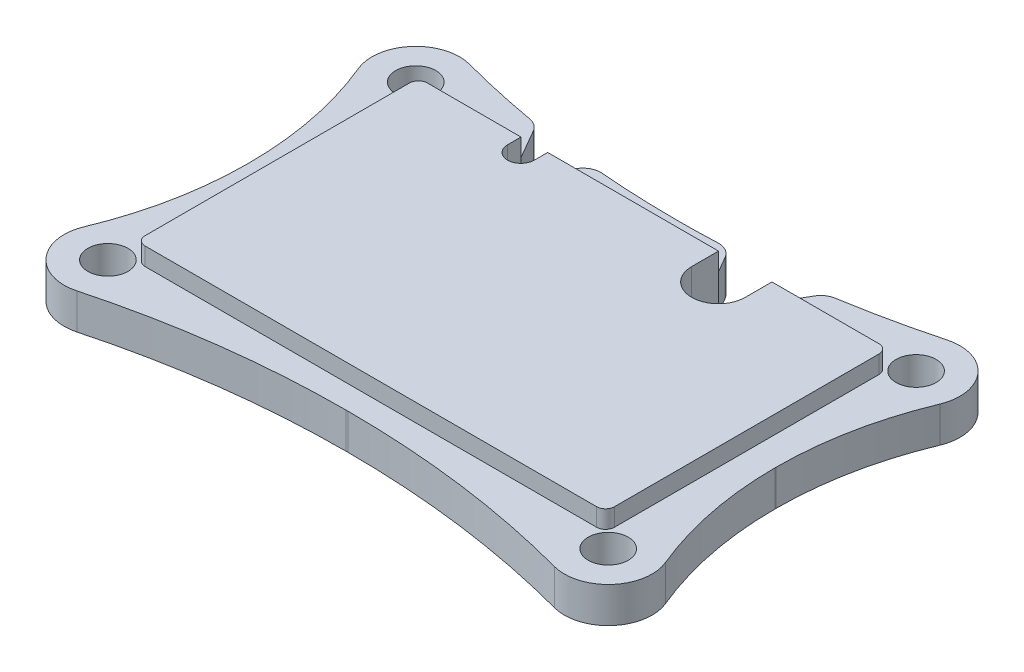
ISO-10303-21;
HEADER;
FILE_DESCRIPTION(('STEP AP214'),'2;1');
FILE_NAME('part.step','',(''),(''),'','','');
FILE_SCHEMA(('AUTOMOTIVE_DESIGN { 1 0 10303 214 1 1 1 1 }'));
ENDSEC;
DATA;
#1=APPLICATION_CONTEXT('core data for automotive mechanical design processes');
#2=APPLICATION_PROTOCOL_DEFINITION('international standard','automotive_design',2000,#1);
#3=PRODUCT_CONTEXT('',#1,'mechanical');
#4=PRODUCT('Part','Part','',(#3));
#5=PRODUCT_RELATED_PRODUCT_CATEGORY('part','',(#4));
#6=PRODUCT_DEFINITION_FORMATION('','',#4);
#7=PRODUCT_DEFINITION_CONTEXT('part definition',#1,'design');
#8=PRODUCT_DEFINITION('design','',#6,#7);
#9=PRODUCT_DEFINITION_SHAPE('','',#8);
#10=(LENGTH_UNIT() NAMED_UNIT(*) SI_UNIT(.MILLI.,.METRE.));
#11=(NAMED_UNIT(*) PLANE_ANGLE_UNIT() SI_UNIT($,.RADIAN.));
#12=(NAMED_UNIT(*) SI_UNIT($,.STERADIAN.) SOLID_ANGLE_UNIT());
#13=UNCERTAINTY_MEASURE_WITH_UNIT(LENGTH_MEASURE(1.E-05),#10,'distance_accuracy_value','');
#14=(GEOMETRIC_REPRESENTATION_CONTEXT(3) GLOBAL_UNCERTAINTY_ASSIGNED_CONTEXT((#13)) GLOBAL_UNIT_ASSIGNED_CONTEXT((#10,
#11,#12)) REPRESENTATION_CONTEXT('',''));
#15=CARTESIAN_POINT('',(0.,0.,0.));
#16=DIRECTION('',(0.,0.,1.));
#17=DIRECTION('',(1.,0.,0.));
#18=AXIS2_PLACEMENT_3D('',#15,#16,#17);
#19=CARTESIAN_POINT('',(-28.0642053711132,0.,-33.1035381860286));
#20=DIRECTION('',(0.,-1.,0.));
#21=DIRECTION('',(0.,0.,-1.));
#22=AXIS2_PLACEMENT_3D('',#19,#20,#21);
#23=PLANE('',#22);
#24=DIRECTION('',(0.499999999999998,0.,0.86602540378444));
#25=VECTOR('',#24,1.);
#26=CARTESIAN_POINT('',(-2.13929158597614,0.,-48.0712941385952));
#27=LINE('',#26,#25);
#28=CARTESIAN_POINT('',(6.31087436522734,0.,-33.4351773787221));
#29=VERTEX_POINT('',#28);
#30=CARTESIAN_POINT('',(7.33,0.,-31.67));
#31=VERTEX_POINT('',#30);
#32=EDGE_CURVE('E453',#29,#31,#27,.T.);
#33=ORIENTED_EDGE('',*,*,#32,.F.);
#34=CARTESIAN_POINT('',(4.57882355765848,0.,-32.4351773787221));
#35=DIRECTION('',(0.,-1.,0.));
#36=DIRECTION('',(0.,0.,-1.));
#37=AXIS2_PLACEMENT_3D('',#34,#35,#36);
#38=CIRCLE('',#37,2.);
#39=CARTESIAN_POINT('',(4.49368647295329,0.,-34.4333644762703));
#40=VERTEX_POINT('',#39);
#41=EDGE_CURVE('E739',#29,#40,#38,.F.);
#42=ORIENTED_EDGE('',*,*,#41,.T.);
#43=CARTESIAN_POINT('',(0.10912661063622,0.,-137.34));
#44=DIRECTION('',(0.,-1.,0.));
#45=DIRECTION('',(0.,0.,-1.));
#46=AXIS2_PLACEMENT_3D('',#43,#44,#45);
#47=CIRCLE('',#46,103.);
#48=CARTESIAN_POINT('',(0.109126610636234,0.,-34.34));
#49=VERTEX_POINT('',#48);
#50=EDGE_CURVE('E699',#40,#49,#47,.T.);
#51=ORIENTED_EDGE('',*,*,#50,.T.);
#52=DIRECTION('',(-1.,0.,0.));
#53=VECTOR('',#52,1.);
#54=CARTESIAN_POINT('',(23.3021089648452,0.,-34.34));
#55=LINE('',#54,#53);
#56=CARTESIAN_POINT('',(-0.109126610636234,0.,-34.34));
#57=VERTEX_POINT('',#56);
#58=EDGE_CURVE('E616',#49,#57,#55,.T.);
#59=ORIENTED_EDGE('',*,*,#58,.T.);
#60=CARTESIAN_POINT('',(-0.109126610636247,0.,-137.34));
#61=DIRECTION('',(0.,-1.,0.));
#62=DIRECTION('',(0.,0.,-1.));
#63=AXIS2_PLACEMENT_3D('',#60,#61,#62);
#64=CIRCLE('',#63,103.);
#65=CARTESIAN_POINT('',(-8.75214199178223,0.,-34.7032702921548));
#66=VERTEX_POINT('',#65);
#67=EDGE_CURVE('E708',#57,#66,#64,.T.);
#68=ORIENTED_EDGE('',*,*,#67,.T.);
#69=CARTESIAN_POINT('',(-8.9199675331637,0.,-32.7103240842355));
#70=DIRECTION('',(0.,-1.,0.));
#71=DIRECTION('',(0.,0.,-1.));
#72=AXIS2_PLACEMENT_3D('',#69,#70,#71);
#73=CIRCLE('',#72,2.);
#74=CARTESIAN_POINT('',(-10.6520183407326,0.,-33.7103240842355));
#75=VERTEX_POINT('',#74);
#76=EDGE_CURVE('E156',#66,#75,#73,.F.);
#77=ORIENTED_EDGE('',*,*,#76,.T.);
#78=DIRECTION('',(0.499999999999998,0.,-0.86602540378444));
#79=VECTOR('',#78,1.);
#80=CARTESIAN_POINT('',(-15.2678110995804,0.,-25.7155365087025));
#81=LINE('',#80,#79);
#82=CARTESIAN_POINT('',(-11.83,0.,-31.67));
#83=VERTEX_POINT('',#82);
#84=EDGE_CURVE('E490',#83,#75,#81,.T.);
#85=ORIENTED_EDGE('',*,*,#84,.F.);
#86=DIRECTION('',(-1.,0.,0.));
#87=VECTOR('',#86,1.);
#88=CARTESIAN_POINT('',(25.33,0.,-31.67));
#89=LINE('',#88,#87);
#90=EDGE_CURVE('E535',#31,#83,#89,.T.);
#91=ORIENTED_EDGE('',*,*,#90,.F.);
#92=EDGE_LOOP('',(#33,#42,#51,#59,#68,#77,#85,#91));
#93=FACE_BOUND('',#92,.T.);
#94=ADVANCED_FACE('F141',(#93),#23,.F.);
#95=CARTESIAN_POINT('',(28.0642053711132,0.,1.43353818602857));
#96=DIRECTION('',(0.,-1.,0.));
#97=DIRECTION('',(0.,0.,-1.));
#98=AXIS2_PLACEMENT_3D('',#95,#96,#97);
#99=CIRCLE('',#98,2.25);
#100=CARTESIAN_POINT('',(28.0642053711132,0.,-0.816461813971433));
#101=VERTEX_POINT('',#100);
#102=EDGE_CURVE('E543',#101,#101,#99,.T.);
#103=ORIENTED_EDGE('',*,*,#102,.T.);
#104=EDGE_LOOP('',(#103));
#105=FACE_BOUND('',#104,.T.);
#106=CARTESIAN_POINT('',(28.0642053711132,0.,-33.1035381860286));
#107=DIRECTION('',(0.,1.,0.));
#108=DIRECTION('',(0.,0.,1.));
#109=AXIS2_PLACEMENT_3D('',#106,#107,#108);
#110=CIRCLE('',#109,2.25);
#111=CARTESIAN_POINT('',(28.0642053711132,0.,-30.8535381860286));
#112=VERTEX_POINT('',#111);
#113=EDGE_CURVE('E567',#112,#112,#110,.T.);
#114=ORIENTED_EDGE('',*,*,#113,.F.);
#115=EDGE_LOOP('',(#114));
#116=FACE_BOUND('',#115,.T.);
#117=CARTESIAN_POINT('',(-28.0642053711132,0.,1.43353818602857));
#118=DIRECTION('',(0.,1.,0.));
#119=DIRECTION('',(0.,0.,1.));
#120=AXIS2_PLACEMENT_3D('',#117,#118,#119);
#121=CIRCLE('',#120,2.25);
#122=CARTESIAN_POINT('',(-28.0642053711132,0.,3.68353818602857));
#123=VERTEX_POINT('',#122);
#124=EDGE_CURVE('E579',#123,#123,#121,.T.);
#125=ORIENTED_EDGE('',*,*,#124,.F.);
#126=EDGE_LOOP('',(#125));
#127=FACE_BOUND('',#126,.T.);
#128=CARTESIAN_POINT('',(-28.0642053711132,0.,-33.1035381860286));
#129=DIRECTION('',(0.,-1.,0.));
#130=DIRECTION('',(0.,0.,-1.));
#131=AXIS2_PLACEMENT_3D('',#128,#129,#130);
#132=CIRCLE('',#131,2.25);
#133=CARTESIAN_POINT('',(-28.0642053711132,0.,-35.3535381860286));
#134=VERTEX_POINT('',#133);
#135=EDGE_CURVE('E573',#134,#134,#132,.T.);
#136=ORIENTED_EDGE('',*,*,#135,.T.);
#137=EDGE_LOOP('',(#136));
#138=FACE_BOUND('',#137,.T.);
#139=CARTESIAN_POINT('',(26.7897521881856,0.,-37.8556081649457));
#140=VERTEX_POINT('',#139);
#141=CARTESIAN_POINT('',(16.4788742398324,0.,-35.649138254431));
#142=VERTEX_POINT('',#141);
#143=EDGE_CURVE('E700',#140,#142,#47,.T.);
#144=ORIENTED_EDGE('',*,*,#143,.T.);
#145=CARTESIAN_POINT('',(16.7967334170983,0.,-33.6745584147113));
#146=DIRECTION('',(0.,-1.,0.));
#147=DIRECTION('',(0.,0.,-1.));
#148=AXIS2_PLACEMENT_3D('',#145,#146,#147);
#149=CIRCLE('',#148,2.);
#150=CARTESIAN_POINT('',(15.0646826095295,0.,-34.6745584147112));
#151=VERTEX_POINT('',#150);
#152=EDGE_CURVE('E733',#142,#151,#149,.F.);
#153=ORIENTED_EDGE('',*,*,#152,.T.);
#154=DIRECTION('',(0.499999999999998,0.,-0.86602540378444));
#155=VECTOR('',#154,1.);
#156=CARTESIAN_POINT('',(3.6021889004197,0.,-14.8209369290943));
#157=LINE('',#156,#155);
#158=CARTESIAN_POINT('',(13.33,0.,-31.67));
#159=VERTEX_POINT('',#158);
#160=EDGE_CURVE('E431',#159,#151,#157,.T.);
#161=ORIENTED_EDGE('',*,*,#160,.F.);
#162=CARTESIAN_POINT('',(25.33,0.,-31.67));
#163=VERTEX_POINT('',#162);
#164=EDGE_CURVE('E531',#163,#159,#89,.T.);
#165=ORIENTED_EDGE('',*,*,#164,.F.);
#166=CARTESIAN_POINT('',(25.33,0.,-30.67));
#167=DIRECTION('',(0.,1.,0.));
#168=DIRECTION('',(0.,0.,1.));
#169=AXIS2_PLACEMENT_3D('',#166,#167,#168);
#170=CIRCLE('',#169,0.999999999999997);
#171=CARTESIAN_POINT('',(26.33,0.,-30.67));
#172=VERTEX_POINT('',#171);
#173=EDGE_CURVE('E534',#172,#163,#170,.T.);
#174=ORIENTED_EDGE('',*,*,#173,.F.);
#175=DIRECTION('',(0.,0.,-1.));
#176=VECTOR('',#175,1.);
#177=CARTESIAN_POINT('',(26.33,0.,-18.915));
#178=LINE('',#177,#176);
#179=CARTESIAN_POINT('',(26.33,0.,-1.00000000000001));
#180=VERTEX_POINT('',#179);
#181=EDGE_CURVE('E498',#180,#172,#178,.T.);
#182=ORIENTED_EDGE('',*,*,#181,.F.);
#183=CARTESIAN_POINT('',(25.33,0.,-1.00000000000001));
#184=DIRECTION('',(0.,1.,0.));
#185=DIRECTION('',(0.,0.,1.));
#186=AXIS2_PLACEMENT_3D('',#183,#184,#185);
#187=CIRCLE('',#186,0.999999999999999);
#188=CARTESIAN_POINT('',(25.33,0.,0.));
#189=VERTEX_POINT('',#188);
#190=EDGE_CURVE('E494',#189,#180,#187,.T.);
#191=ORIENTED_EDGE('',*,*,#190,.F.);
#192=DIRECTION('',(1.,0.,0.));
#193=VECTOR('',#192,1.);
#194=CARTESIAN_POINT('',(-25.33,0.,0.));
#195=LINE('',#194,#193);
#196=CARTESIAN_POINT('',(-25.33,0.,0.));
#197=VERTEX_POINT('',#196);
#198=EDGE_CURVE('E520',#197,#189,#195,.T.);
#199=ORIENTED_EDGE('',*,*,#198,.F.);
#200=CARTESIAN_POINT('',(-25.33,0.,-1.));
#201=DIRECTION('',(0.,-1.,0.));
#202=DIRECTION('',(0.,0.,-1.));
#203=AXIS2_PLACEMENT_3D('',#200,#201,#202);
#204=CIRCLE('',#203,0.999999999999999);
#205=CARTESIAN_POINT('',(-26.33,0.,-1.));
#206=VERTEX_POINT('',#205);
#207=EDGE_CURVE('E523',#197,#206,#204,.T.);
#208=ORIENTED_EDGE('',*,*,#207,.T.);
#209=DIRECTION('',(0.,0.,-1.));
#210=VECTOR('',#209,1.);
#211=CARTESIAN_POINT('',(-26.33,0.,-18.915));
#212=LINE('',#211,#210);
#213=CARTESIAN_POINT('',(-26.33,0.,-30.67));
#214=VERTEX_POINT('',#213);
#215=EDGE_CURVE('E525',#206,#214,#212,.T.);
#216=ORIENTED_EDGE('',*,*,#215,.T.);
#217=CARTESIAN_POINT('',(-25.33,0.,-30.67));
#218=DIRECTION('',(0.,-1.,0.));
#219=DIRECTION('',(0.,0.,-1.));
#220=AXIS2_PLACEMENT_3D('',#217,#218,#219);
#221=CIRCLE('',#220,0.999999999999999);
#222=CARTESIAN_POINT('',(-25.33,0.,-31.67));
#223=VERTEX_POINT('',#222);
#224=EDGE_CURVE('E527',#214,#223,#221,.T.);
#225=ORIENTED_EDGE('',*,*,#224,.T.);
#226=CARTESIAN_POINT('',(-14.83,0.,-31.67));
#227=VERTEX_POINT('',#226);
#228=EDGE_CURVE('E530',#227,#223,#89,.T.);
#229=ORIENTED_EDGE('',*,*,#228,.F.);
#230=DIRECTION('',(0.499999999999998,0.,0.86602540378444));
#231=VECTOR('',#230,1.);
#232=CARTESIAN_POINT('',(-18.7592915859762,0.,-38.4757326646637));
#233=LINE('',#232,#231);
#234=CARTESIAN_POINT('',(-16.727103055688,0.,-34.9558788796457));
#235=VERTEX_POINT('',#234);
#236=EDGE_CURVE('E492',#235,#227,#233,.T.);
#237=ORIENTED_EDGE('',*,*,#236,.F.);
#238=CARTESIAN_POINT('',(-18.4591538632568,0.,-33.9558788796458));
#239=DIRECTION('',(0.,-1.,0.));
#240=DIRECTION('',(0.,0.,-1.));
#241=AXIS2_PLACEMENT_3D('',#238,#239,#240);
#242=CIRCLE('',#241,2.);
#243=CARTESIAN_POINT('',(-18.1096295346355,0.,-35.9251002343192));
#244=VERTEX_POINT('',#243);
#245=EDGE_CURVE('E731',#235,#244,#242,.F.);
#246=ORIENTED_EDGE('',*,*,#245,.T.);
#247=CARTESIAN_POINT('',(-26.7897521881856,0.,-37.8556081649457));
#248=VERTEX_POINT('',#247);
#249=EDGE_CURVE('E707',#244,#248,#64,.T.);
#250=ORIENTED_EDGE('',*,*,#249,.T.);
#251=CARTESIAN_POINT('',(-28.0642053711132,0.,-33.1035381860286));
#252=DIRECTION('',(0.,-1.,0.));
#253=DIRECTION('',(0.,0.,-1.));
#254=AXIS2_PLACEMENT_3D('',#251,#252,#253);
#255=CIRCLE('',#254,4.92000000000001);
#256=CARTESIAN_POINT('',(-32.609158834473,0.,-31.2194474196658));
#257=VERTEX_POINT('',#256);
#258=EDGE_CURVE('E585',#257,#248,#255,.T.);
#259=ORIENTED_EDGE('',*,*,#258,.F.);
#260=CARTESIAN_POINT('',(-69.56,0.,-15.901636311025));
#261=DIRECTION('',(0.,-1.,0.));
#262=DIRECTION('',(0.,0.,-1.));
#263=AXIS2_PLACEMENT_3D('',#260,#261,#262);
#264=CIRCLE('',#263,40.);
#265=CARTESIAN_POINT('',(-29.56,0.,-15.901636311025));
#266=VERTEX_POINT('',#265);
#267=EDGE_CURVE('E667',#257,#266,#264,.T.);
#268=ORIENTED_EDGE('',*,*,#267,.T.);
#269=DIRECTION('',(0.,0.,1.));
#270=VECTOR('',#269,1.);
#271=CARTESIAN_POINT('',(-29.56,0.,-28.4164283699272));
#272=LINE('',#271,#270);
#273=CARTESIAN_POINT('',(-29.56,0.,-15.7683636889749));
#274=VERTEX_POINT('',#273);
#275=EDGE_CURVE('E592',#266,#274,#272,.T.);
#276=ORIENTED_EDGE('',*,*,#275,.T.);
#277=CARTESIAN_POINT('',(-69.56,0.,-15.7683636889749));
#278=DIRECTION('',(0.,-1.,0.));
#279=DIRECTION('',(0.,0.,-1.));
#280=AXIS2_PLACEMENT_3D('',#277,#278,#279);
#281=CIRCLE('',#280,40.);
#282=CARTESIAN_POINT('',(-32.609158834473,0.,-0.450552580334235));
#283=VERTEX_POINT('',#282);
#284=EDGE_CURVE('E663',#274,#283,#281,.T.);
#285=ORIENTED_EDGE('',*,*,#284,.T.);
#286=CARTESIAN_POINT('',(-28.0642053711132,0.,1.43353818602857));
#287=DIRECTION('',(0.,1.,0.));
#288=DIRECTION('',(0.,0.,1.));
#289=AXIS2_PLACEMENT_3D('',#286,#287,#288);
#290=CIRCLE('',#289,4.92);
#291=CARTESIAN_POINT('',(-26.7897521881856,0.,6.18560816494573));
#292=VERTEX_POINT('',#291);
#293=EDGE_CURVE('E631',#283,#292,#290,.T.);
#294=ORIENTED_EDGE('',*,*,#293,.T.);
#295=CARTESIAN_POINT('',(-0.10912661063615,0.,105.67));
#296=DIRECTION('',(0.,-1.,0.));
#297=DIRECTION('',(0.,0.,-1.));
#298=AXIS2_PLACEMENT_3D('',#295,#296,#297);
#299=CIRCLE('',#298,103.);
#300=CARTESIAN_POINT('',(-0.109126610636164,0.,2.67));
#301=VERTEX_POINT('',#300);
#302=EDGE_CURVE('E695',#292,#301,#299,.T.);
#303=ORIENTED_EDGE('',*,*,#302,.T.);
#304=DIRECTION('',(-1.,0.,0.));
#305=VECTOR('',#304,1.);
#306=CARTESIAN_POINT('',(23.3021089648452,0.,2.67));
#307=LINE('',#306,#305);
#308=CARTESIAN_POINT('',(0.109126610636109,0.,2.67));
#309=VERTEX_POINT('',#308);
#310=EDGE_CURVE('E628',#309,#301,#307,.T.);
#311=ORIENTED_EDGE('',*,*,#310,.F.);
#312=CARTESIAN_POINT('',(0.109126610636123,0.,105.67));
#313=DIRECTION('',(0.,-1.,0.));
#314=DIRECTION('',(0.,0.,-1.));
#315=AXIS2_PLACEMENT_3D('',#312,#313,#314);
#316=CIRCLE('',#315,103.);
#317=CARTESIAN_POINT('',(26.7897521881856,0.,6.18560816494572));
#318=VERTEX_POINT('',#317);
#319=EDGE_CURVE('E691',#309,#318,#316,.T.);
#320=ORIENTED_EDGE('',*,*,#319,.T.);
#321=CARTESIAN_POINT('',(28.0642053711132,0.,1.43353818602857));
#322=DIRECTION('',(0.,-1.,0.));
#323=DIRECTION('',(0.,0.,-1.));
#324=AXIS2_PLACEMENT_3D('',#321,#322,#323);
#325=CIRCLE('',#324,4.92);
#326=CARTESIAN_POINT('',(32.609158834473,0.,-0.450552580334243));
#327=VERTEX_POINT('',#326);
#328=EDGE_CURVE('E625',#327,#318,#325,.T.);
#329=ORIENTED_EDGE('',*,*,#328,.F.);
#330=CARTESIAN_POINT('',(69.56,0.,-15.768363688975));
#331=DIRECTION('',(0.,-1.,0.));
#332=DIRECTION('',(0.,0.,-1.));
#333=AXIS2_PLACEMENT_3D('',#330,#331,#332);
#334=CIRCLE('',#333,40.);
#335=CARTESIAN_POINT('',(29.56,0.,-15.768363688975));
#336=VERTEX_POINT('',#335);
#337=EDGE_CURVE('E655',#327,#336,#334,.T.);
#338=ORIENTED_EDGE('',*,*,#337,.T.);
#339=DIRECTION('',(0.,0.,1.));
#340=VECTOR('',#339,1.);
#341=CARTESIAN_POINT('',(29.56,0.,-28.4164283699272));
#342=LINE('',#341,#340);
#343=CARTESIAN_POINT('',(29.56,0.,-15.901636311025));
#344=VERTEX_POINT('',#343);
#345=EDGE_CURVE('E622',#344,#336,#342,.T.);
#346=ORIENTED_EDGE('',*,*,#345,.F.);
#347=CARTESIAN_POINT('',(69.56,0.,-15.9016363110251));
#348=DIRECTION('',(0.,-1.,0.));
#349=DIRECTION('',(0.,0.,-1.));
#350=AXIS2_PLACEMENT_3D('',#347,#348,#349);
#351=CIRCLE('',#350,40.);
#352=CARTESIAN_POINT('',(32.609158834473,0.,-31.2194474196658));
#353=VERTEX_POINT('',#352);
#354=EDGE_CURVE('E659',#344,#353,#351,.T.);
#355=ORIENTED_EDGE('',*,*,#354,.T.);
#356=CARTESIAN_POINT('',(28.0642053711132,0.,-33.1035381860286));
#357=DIRECTION('',(0.,1.,0.));
#358=DIRECTION('',(0.,0.,1.));
#359=AXIS2_PLACEMENT_3D('',#356,#357,#358);
#360=CIRCLE('',#359,4.92000000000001);
#361=EDGE_CURVE('E619',#353,#140,#360,.T.);
#362=ORIENTED_EDGE('',*,*,#361,.T.);
#363=EDGE_LOOP('',(#144,#153,#161,#165,#174,#182,#191,#199,#208,#216,#225,#229,#237,#246,#250,
#259,#268,#276,#285,#294,#303,#311,#320,#329,#338,#346,#355,#362));
#364=FACE_BOUND('',#363,.T.);
#365=ADVANCED_FACE('F757',(#105,#116,#127,#138,#364),#23,.F.);
#366=CARTESIAN_POINT('',(-28.0642053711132,-4.,-33.1035381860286));
#367=DIRECTION('',(0.,-1.,0.));
#368=DIRECTION('',(0.,0.,-1.));
#369=AXIS2_PLACEMENT_3D('',#366,#367,#368);
#370=PLANE('',#369);
#371=CARTESIAN_POINT('',(-28.0642053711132,-4.,-33.1035381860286));
#372=DIRECTION('',(0.,-1.,0.));
#373=DIRECTION('',(0.,0.,-1.));
#374=AXIS2_PLACEMENT_3D('',#371,#372,#373);
#375=CIRCLE('',#374,2.25);
#376=CARTESIAN_POINT('',(-28.0642053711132,-4.,-35.3535381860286));
#377=VERTEX_POINT('',#376);
#378=EDGE_CURVE('E576',#377,#377,#375,.T.);
#379=ORIENTED_EDGE('',*,*,#378,.F.);
#380=EDGE_LOOP('',(#379));
#381=FACE_BOUND('',#380,.T.);
#382=CARTESIAN_POINT('',(-28.0642053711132,-4.,1.43353818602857));
#383=DIRECTION('',(0.,1.,0.));
#384=DIRECTION('',(0.,0.,1.));
#385=AXIS2_PLACEMENT_3D('',#382,#383,#384);
#386=CIRCLE('',#385,2.25);
#387=CARTESIAN_POINT('',(-28.0642053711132,-4.,3.68353818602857));
#388=VERTEX_POINT('',#387);
#389=EDGE_CURVE('E582',#388,#388,#386,.T.);
#390=ORIENTED_EDGE('',*,*,#389,.T.);
#391=EDGE_LOOP('',(#390));
#392=FACE_BOUND('',#391,.T.);
#393=CARTESIAN_POINT('',(28.0642053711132,-4.,-33.1035381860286));
#394=DIRECTION('',(0.,1.,0.));
#395=DIRECTION('',(0.,0.,1.));
#396=AXIS2_PLACEMENT_3D('',#393,#394,#395);
#397=CIRCLE('',#396,2.25);
#398=CARTESIAN_POINT('',(28.0642053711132,-4.,-30.8535381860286));
#399=VERTEX_POINT('',#398);
#400=EDGE_CURVE('E570',#399,#399,#397,.T.);
#401=ORIENTED_EDGE('',*,*,#400,.T.);
#402=EDGE_LOOP('',(#401));
#403=FACE_BOUND('',#402,.T.);
#404=CARTESIAN_POINT('',(28.0642053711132,-4.,1.43353818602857));
#405=DIRECTION('',(0.,-1.,0.));
#406=DIRECTION('',(0.,0.,-1.));
#407=AXIS2_PLACEMENT_3D('',#404,#405,#406);
#408=CIRCLE('',#407,2.25);
#409=CARTESIAN_POINT('',(28.0642053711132,-4.,-0.816461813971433));
#410=VERTEX_POINT('',#409);
#411=EDGE_CURVE('E564',#410,#410,#408,.T.);
#412=ORIENTED_EDGE('',*,*,#411,.F.);
#413=EDGE_LOOP('',(#412));
#414=FACE_BOUND('',#413,.T.);
#415=DIRECTION('',(-0.499999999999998,0.,0.86602540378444));
#416=VECTOR('',#415,1.);
#417=CARTESIAN_POINT('',(18.0227927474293,-4.,-39.7981554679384));
#418=LINE('',#417,#416);
#419=CARTESIAN_POINT('',(15.0646826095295,-4.,-34.6745584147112));
#420=VERTEX_POINT('',#419);
#421=CARTESIAN_POINT('',(13.33,-4.,-31.67));
#422=VERTEX_POINT('',#421);
#423=EDGE_CURVE('E447',#420,#422,#418,.T.);
#424=ORIENTED_EDGE('',*,*,#423,.F.);
#425=CARTESIAN_POINT('',(16.7967334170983,-4.,-33.6745584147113));
#426=DIRECTION('',(0.,-1.,0.));
#427=DIRECTION('',(0.,0.,-1.));
#428=AXIS2_PLACEMENT_3D('',#425,#426,#427);
#429=CIRCLE('',#428,2.);
#430=CARTESIAN_POINT('',(16.4788742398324,-4.,-35.649138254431));
#431=VERTEX_POINT('',#430);
#432=EDGE_CURVE('E727',#420,#431,#429,.T.);
#433=ORIENTED_EDGE('',*,*,#432,.T.);
#434=CARTESIAN_POINT('',(0.10912661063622,-4.,-137.34));
#435=DIRECTION('',(0.,-1.,0.));
#436=DIRECTION('',(0.,0.,-1.));
#437=AXIS2_PLACEMENT_3D('',#434,#435,#436);
#438=CIRCLE('',#437,103.);
#439=CARTESIAN_POINT('',(26.7897521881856,-4.,-37.8556081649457));
#440=VERTEX_POINT('',#439);
#441=EDGE_CURVE('E703',#431,#440,#438,.F.);
#442=ORIENTED_EDGE('',*,*,#441,.T.);
#443=CARTESIAN_POINT('',(28.0642053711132,-4.,-33.1035381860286));
#444=DIRECTION('',(0.,1.,0.));
#445=DIRECTION('',(0.,0.,1.));
#446=AXIS2_PLACEMENT_3D('',#443,#444,#445);
#447=CIRCLE('',#446,4.92000000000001);
#448=CARTESIAN_POINT('',(32.609158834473,-4.,-31.2194474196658));
#449=VERTEX_POINT('',#448);
#450=EDGE_CURVE('E595',#449,#440,#447,.T.);
#451=ORIENTED_EDGE('',*,*,#450,.F.);
#452=CARTESIAN_POINT('',(69.56,-4.,-15.9016363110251));
#453=DIRECTION('',(0.,-1.,0.));
#454=DIRECTION('',(0.,0.,-1.));
#455=AXIS2_PLACEMENT_3D('',#452,#453,#454);
#456=CIRCLE('',#455,40.);
#457=CARTESIAN_POINT('',(29.56,-4.,-15.901636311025));
#458=VERTEX_POINT('',#457);
#459=EDGE_CURVE('E661',#449,#458,#456,.F.);
#460=ORIENTED_EDGE('',*,*,#459,.T.);
#461=DIRECTION('',(0.,0.,1.));
#462=VECTOR('',#461,1.);
#463=CARTESIAN_POINT('',(29.56,-4.,-28.4164283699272));
#464=LINE('',#463,#462);
#465=CARTESIAN_POINT('',(29.56,-4.,-15.768363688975));
#466=VERTEX_POINT('',#465);
#467=EDGE_CURVE('E598',#458,#466,#464,.T.);
#468=ORIENTED_EDGE('',*,*,#467,.T.);
#469=CARTESIAN_POINT('',(69.56,-4.,-15.768363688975));
#470=DIRECTION('',(0.,-1.,0.));
#471=DIRECTION('',(0.,0.,-1.));
#472=AXIS2_PLACEMENT_3D('',#469,#470,#471);
#473=CIRCLE('',#472,40.);
#474=CARTESIAN_POINT('',(32.609158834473,-4.,-0.450552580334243));
#475=VERTEX_POINT('',#474);
#476=EDGE_CURVE('E657',#466,#475,#473,.F.);
#477=ORIENTED_EDGE('',*,*,#476,.T.);
#478=CARTESIAN_POINT('',(28.0642053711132,-4.,1.43353818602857));
#479=DIRECTION('',(0.,-1.,0.));
#480=DIRECTION('',(0.,0.,-1.));
#481=AXIS2_PLACEMENT_3D('',#478,#479,#480);
#482=CIRCLE('',#481,4.92);
#483=CARTESIAN_POINT('',(26.7897521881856,-4.,6.18560816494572));
#484=VERTEX_POINT('',#483);
#485=EDGE_CURVE('E601',#475,#484,#482,.T.);
#486=ORIENTED_EDGE('',*,*,#485,.T.);
#487=CARTESIAN_POINT('',(0.109126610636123,-4.,105.67));
#488=DIRECTION('',(0.,-1.,0.));
#489=DIRECTION('',(0.,0.,-1.));
#490=AXIS2_PLACEMENT_3D('',#487,#488,#489);
#491=CIRCLE('',#490,103.);
#492=CARTESIAN_POINT('',(0.109126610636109,-4.,2.67));
#493=VERTEX_POINT('',#492);
#494=EDGE_CURVE('E693',#484,#493,#491,.F.);
#495=ORIENTED_EDGE('',*,*,#494,.T.);
#496=DIRECTION('',(-1.,0.,0.));
#497=VECTOR('',#496,1.);
#498=CARTESIAN_POINT('',(23.3021089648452,-4.,2.67));
#499=LINE('',#498,#497);
#500=CARTESIAN_POINT('',(-0.109126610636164,-4.,2.67));
#501=VERTEX_POINT('',#500);
#502=EDGE_CURVE('E604',#493,#501,#499,.T.);
#503=ORIENTED_EDGE('',*,*,#502,.T.);
#504=CARTESIAN_POINT('',(-0.10912661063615,-4.,105.67));
#505=DIRECTION('',(0.,-1.,0.));
#506=DIRECTION('',(0.,0.,-1.));
#507=AXIS2_PLACEMENT_3D('',#504,#505,#506);
#508=CIRCLE('',#507,103.);
#509=CARTESIAN_POINT('',(-26.7897521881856,-4.,6.18560816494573));
#510=VERTEX_POINT('',#509);
#511=EDGE_CURVE('E697',#501,#510,#508,.F.);
#512=ORIENTED_EDGE('',*,*,#511,.T.);
#513=CARTESIAN_POINT('',(-28.0642053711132,-4.,1.43353818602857));
#514=DIRECTION('',(0.,1.,0.));
#515=DIRECTION('',(0.,0.,1.));
#516=AXIS2_PLACEMENT_3D('',#513,#514,#515);
#517=CIRCLE('',#516,4.92);
#518=CARTESIAN_POINT('',(-32.609158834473,-4.,-0.450552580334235));
#519=VERTEX_POINT('',#518);
#520=EDGE_CURVE('E607',#519,#510,#517,.T.);
#521=ORIENTED_EDGE('',*,*,#520,.F.);
#522=CARTESIAN_POINT('',(-69.56,-4.,-15.7683636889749));
#523=DIRECTION('',(0.,-1.,0.));
#524=DIRECTION('',(0.,0.,-1.));
#525=AXIS2_PLACEMENT_3D('',#522,#523,#524);
#526=CIRCLE('',#525,40.);
#527=CARTESIAN_POINT('',(-29.56,-4.,-15.7683636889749));
#528=VERTEX_POINT('',#527);
#529=EDGE_CURVE('E665',#519,#528,#526,.F.);
#530=ORIENTED_EDGE('',*,*,#529,.T.);
#531=DIRECTION('',(0.,0.,1.));
#532=VECTOR('',#531,1.);
#533=CARTESIAN_POINT('',(-29.56,-4.,-28.4164283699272));
#534=LINE('',#533,#532);
#535=CARTESIAN_POINT('',(-29.56,-4.,-15.901636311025));
#536=VERTEX_POINT('',#535);
#537=EDGE_CURVE('E610',#536,#528,#534,.T.);
#538=ORIENTED_EDGE('',*,*,#537,.F.);
#539=CARTESIAN_POINT('',(-69.56,-4.,-15.901636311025));
#540=DIRECTION('',(0.,-1.,0.));
#541=DIRECTION('',(0.,0.,-1.));
#542=AXIS2_PLACEMENT_3D('',#539,#540,#541);
#543=CIRCLE('',#542,40.);
#544=CARTESIAN_POINT('',(-32.609158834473,-4.,-31.2194474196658));
#545=VERTEX_POINT('',#544);
#546=EDGE_CURVE('E669',#536,#545,#543,.F.);
#547=ORIENTED_EDGE('',*,*,#546,.T.);
#548=CARTESIAN_POINT('',(-28.0642053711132,-4.,-33.1035381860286));
#549=DIRECTION('',(0.,-1.,0.));
#550=DIRECTION('',(0.,0.,-1.));
#551=AXIS2_PLACEMENT_3D('',#548,#549,#550);
#552=CIRCLE('',#551,4.92000000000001);
#553=CARTESIAN_POINT('',(-26.7897521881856,-4.,-37.8556081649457));
#554=VERTEX_POINT('',#553);
#555=EDGE_CURVE('E588',#545,#554,#552,.T.);
#556=ORIENTED_EDGE('',*,*,#555,.T.);
#557=CARTESIAN_POINT('',(-0.109126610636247,-4.,-137.34));
#558=DIRECTION('',(0.,-1.,0.));
#559=DIRECTION('',(0.,0.,-1.));
#560=AXIS2_PLACEMENT_3D('',#557,#558,#559);
#561=CIRCLE('',#560,103.);
#562=CARTESIAN_POINT('',(-18.1096295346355,-4.,-35.9251002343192));
#563=VERTEX_POINT('',#562);
#564=EDGE_CURVE('E711',#554,#563,#561,.F.);
#565=ORIENTED_EDGE('',*,*,#564,.T.);
#566=CARTESIAN_POINT('',(-18.4591538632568,-4.,-33.9558788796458));
#567=DIRECTION('',(0.,-1.,0.));
#568=DIRECTION('',(0.,0.,-1.));
#569=AXIS2_PLACEMENT_3D('',#566,#567,#568);
#570=CIRCLE('',#569,2.);
#571=CARTESIAN_POINT('',(-16.727103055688,-4.,-34.9558788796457));
#572=VERTEX_POINT('',#571);
#573=EDGE_CURVE('E721',#563,#572,#570,.T.);
#574=ORIENTED_EDGE('',*,*,#573,.T.);
#575=DIRECTION('',(-0.499999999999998,0.,-0.86602540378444));
#576=VECTOR('',#575,1.);
#577=CARTESIAN_POINT('',(-14.83,-4.,-31.67));
#578=LINE('',#577,#576);
#579=CARTESIAN_POINT('',(-14.83,-4.,-31.67));
#580=VERTEX_POINT('',#579);
#581=EDGE_CURVE('E458',#580,#572,#578,.T.);
#582=ORIENTED_EDGE('',*,*,#581,.F.);
#583=DIRECTION('',(0.,0.,-1.));
#584=VECTOR('',#583,1.);
#585=CARTESIAN_POINT('',(-14.83,-4.,-30.17));
#586=LINE('',#585,#584);
#587=CARTESIAN_POINT('',(-14.83,-4.,-30.17));
#588=VERTEX_POINT('',#587);
#589=EDGE_CURVE('E456',#588,#580,#586,.T.);
#590=ORIENTED_EDGE('',*,*,#589,.F.);
#591=CARTESIAN_POINT('',(-13.33,-4.,-30.17));
#592=DIRECTION('',(0.,1.,0.));
#593=DIRECTION('',(0.,0.,1.));
#594=AXIS2_PLACEMENT_3D('',#591,#592,#593);
#595=CIRCLE('',#594,1.5);
#596=CARTESIAN_POINT('',(-11.83,-4.,-30.17));
#597=VERTEX_POINT('',#596);
#598=EDGE_CURVE('E467',#588,#597,#595,.T.);
#599=ORIENTED_EDGE('',*,*,#598,.T.);
#600=DIRECTION('',(0.,0.,-1.));
#601=VECTOR('',#600,1.);
#602=CARTESIAN_POINT('',(-11.83,-4.,-30.17));
#603=LINE('',#602,#601);
#604=CARTESIAN_POINT('',(-11.83,-4.,-31.67));
#605=VERTEX_POINT('',#604);
#606=EDGE_CURVE('E464',#597,#605,#603,.T.);
#607=ORIENTED_EDGE('',*,*,#606,.T.);
#608=DIRECTION('',(-0.499999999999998,0.,0.86602540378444));
#609=VECTOR('',#608,1.);
#610=CARTESIAN_POINT('',(-7.13720725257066,-4.,-39.7981554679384));
#611=LINE('',#610,#609);
#612=CARTESIAN_POINT('',(-10.6520183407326,-4.,-33.7103240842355));
#613=VERTEX_POINT('',#612);
#614=EDGE_CURVE('E462',#613,#605,#611,.T.);
#615=ORIENTED_EDGE('',*,*,#614,.F.);
#616=CARTESIAN_POINT('',(-8.9199675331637,-4.,-32.7103240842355));
#617=DIRECTION('',(0.,-1.,0.));
#618=DIRECTION('',(0.,0.,-1.));
#619=AXIS2_PLACEMENT_3D('',#616,#617,#618);
#620=CIRCLE('',#619,2.);
#621=CARTESIAN_POINT('',(-8.75214199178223,-4.,-34.7032702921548));
#622=VERTEX_POINT('',#621);
#623=EDGE_CURVE('E723',#613,#622,#620,.T.);
#624=ORIENTED_EDGE('',*,*,#623,.T.);
#625=CARTESIAN_POINT('',(-0.109126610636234,-4.,-34.34));
#626=VERTEX_POINT('',#625);
#627=EDGE_CURVE('E710',#622,#626,#561,.F.);
#628=ORIENTED_EDGE('',*,*,#627,.T.);
#629=DIRECTION('',(-1.,0.,0.));
#630=VECTOR('',#629,1.);
#631=CARTESIAN_POINT('',(23.3021089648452,-4.,-34.34));
#632=LINE('',#631,#630);
#633=CARTESIAN_POINT('',(0.109126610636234,-4.,-34.34));
#634=VERTEX_POINT('',#633);
#635=EDGE_CURVE('E591',#634,#626,#632,.T.);
#636=ORIENTED_EDGE('',*,*,#635,.F.);
#637=CARTESIAN_POINT('',(4.49368647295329,-4.,-34.4333644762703));
#638=VERTEX_POINT('',#637);
#639=EDGE_CURVE('E704',#634,#638,#438,.F.);
#640=ORIENTED_EDGE('',*,*,#639,.T.);
#641=CARTESIAN_POINT('',(4.57882355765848,-4.,-32.4351773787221));
#642=DIRECTION('',(0.,-1.,0.));
#643=DIRECTION('',(0.,0.,-1.));
#644=AXIS2_PLACEMENT_3D('',#641,#642,#643);
#645=CIRCLE('',#644,2.);
#646=CARTESIAN_POINT('',(6.31087436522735,-4.,-33.4351773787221));
#647=VERTEX_POINT('',#646);
#648=EDGE_CURVE('E725',#638,#647,#645,.T.);
#649=ORIENTED_EDGE('',*,*,#648,.T.);
#650=DIRECTION('',(-0.499999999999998,0.,-0.86602540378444));
#651=VECTOR('',#650,1.);
#652=CARTESIAN_POINT('',(7.33,-4.,-31.67));
#653=LINE('',#652,#651);
#654=CARTESIAN_POINT('',(7.33,-4.,-31.67));
#655=VERTEX_POINT('',#654);
#656=EDGE_CURVE('E439',#655,#647,#653,.T.);
#657=ORIENTED_EDGE('',*,*,#656,.F.);
#658=DIRECTION('',(0.,0.,-1.));
#659=VECTOR('',#658,1.);
#660=CARTESIAN_POINT('',(7.33,-4.,-28.67));
#661=LINE('',#660,#659);
#662=CARTESIAN_POINT('',(7.33,-4.,-28.67));
#663=VERTEX_POINT('',#662);
#664=EDGE_CURVE('E436',#663,#655,#661,.T.);
#665=ORIENTED_EDGE('',*,*,#664,.F.);
#666=CARTESIAN_POINT('',(10.33,-4.,-28.67));
#667=DIRECTION('',(0.,1.,0.));
#668=DIRECTION('',(0.,0.,1.));
#669=AXIS2_PLACEMENT_3D('',#666,#667,#668);
#670=CIRCLE('',#669,3.);
#671=CARTESIAN_POINT('',(13.33,-4.,-28.67));
#672=VERTEX_POINT('',#671);
#673=EDGE_CURVE('E418',#663,#672,#670,.T.);
#674=ORIENTED_EDGE('',*,*,#673,.T.);
#675=DIRECTION('',(0.,0.,-1.));
#676=VECTOR('',#675,1.);
#677=CARTESIAN_POINT('',(13.33,-4.,-28.67));
#678=LINE('',#677,#676);
#679=EDGE_CURVE('E444',#672,#422,#678,.T.);
#680=ORIENTED_EDGE('',*,*,#679,.T.);
#681=EDGE_LOOP('',(#424,#433,#442,#451,#460,#468,#477,#486,#495,#503,#512,#521,#530,#538,#547,
#556,#565,#574,#582,#590,#599,#607,#615,#624,#628,#636,#640,#649,#657,#665,#674,#680));
#682=FACE_BOUND('',#681,.T.);
#683=ADVANCED_FACE('F783',(#381,#392,#403,#414,#682),#370,.T.);
#684=CARTESIAN_POINT('',(25.33,2.,-1.00000000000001));
#685=DIRECTION('',(0.,1.,0.));
#686=DIRECTION('',(0.,0.,1.));
#687=AXIS2_PLACEMENT_3D('',#684,#685,#686);
#688=PLANE('',#687);
#689=CARTESIAN_POINT('',(10.33,2.,-28.67));
#690=DIRECTION('',(0.,1.,0.));
#691=DIRECTION('',(0.,0.,1.));
#692=AXIS2_PLACEMENT_3D('',#689,#690,#691);
#693=CIRCLE('',#692,3.);
#694=CARTESIAN_POINT('',(7.33,2.,-28.67));
#695=VERTEX_POINT('',#694);
#696=CARTESIAN_POINT('',(13.33,2.,-28.67));
#697=VERTEX_POINT('',#696);
#698=EDGE_CURVE('E415',#695,#697,#693,.T.);
#699=ORIENTED_EDGE('',*,*,#698,.F.);
#700=DIRECTION('',(0.,0.,-1.));
#701=VECTOR('',#700,1.);
#702=CARTESIAN_POINT('',(7.33,2.,-28.67));
#703=LINE('',#702,#701);
#704=CARTESIAN_POINT('',(7.33,2.,-31.67));
#705=VERTEX_POINT('',#704);
#706=EDGE_CURVE('E424',#695,#705,#703,.T.);
#707=ORIENTED_EDGE('',*,*,#706,.T.);
#708=DIRECTION('',(-1.,0.,0.));
#709=VECTOR('',#708,1.);
#710=CARTESIAN_POINT('',(25.33,2.,-31.67));
#711=LINE('',#710,#709);
#712=CARTESIAN_POINT('',(-11.83,2.,-31.67));
#713=VERTEX_POINT('',#712);
#714=EDGE_CURVE('E515',#705,#713,#711,.T.);
#715=ORIENTED_EDGE('',*,*,#714,.T.);
#716=DIRECTION('',(0.,0.,-1.));
#717=VECTOR('',#716,1.);
#718=CARTESIAN_POINT('',(-11.83,2.,-30.17));
#719=LINE('',#718,#717);
#720=CARTESIAN_POINT('',(-11.83,2.,-30.17));
#721=VERTEX_POINT('',#720);
#722=EDGE_CURVE('E473',#721,#713,#719,.T.);
#723=ORIENTED_EDGE('',*,*,#722,.F.);
#724=CARTESIAN_POINT('',(-13.33,2.,-30.17));
#725=DIRECTION('',(0.,1.,0.));
#726=DIRECTION('',(0.,0.,1.));
#727=AXIS2_PLACEMENT_3D('',#724,#725,#726);
#728=CIRCLE('',#727,1.5);
#729=CARTESIAN_POINT('',(-14.83,2.,-30.17));
#730=VERTEX_POINT('',#729);
#731=EDGE_CURVE('E459',#730,#721,#728,.T.);
#732=ORIENTED_EDGE('',*,*,#731,.F.);
#733=DIRECTION('',(0.,0.,-1.));
#734=VECTOR('',#733,1.);
#735=CARTESIAN_POINT('',(-14.83,2.,-30.17));
#736=LINE('',#735,#734);
#737=CARTESIAN_POINT('',(-14.83,2.,-31.67));
#738=VERTEX_POINT('',#737);
#739=EDGE_CURVE('E455',#730,#738,#736,.T.);
#740=ORIENTED_EDGE('',*,*,#739,.T.);
#741=CARTESIAN_POINT('',(-25.33,2.,-31.67));
#742=VERTEX_POINT('',#741);
#743=EDGE_CURVE('E511',#738,#742,#711,.T.);
#744=ORIENTED_EDGE('',*,*,#743,.T.);
#745=CARTESIAN_POINT('',(-25.33,2.,-30.67));
#746=DIRECTION('',(0.,-1.,0.));
#747=DIRECTION('',(0.,0.,-1.));
#748=AXIS2_PLACEMENT_3D('',#745,#746,#747);
#749=CIRCLE('',#748,0.999999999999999);
#750=CARTESIAN_POINT('',(-26.33,2.,-30.67));
#751=VERTEX_POINT('',#750);
#752=EDGE_CURVE('E508',#751,#742,#749,.T.);
#753=ORIENTED_EDGE('',*,*,#752,.F.);
#754=DIRECTION('',(0.,0.,-1.));
#755=VECTOR('',#754,1.);
#756=CARTESIAN_POINT('',(-26.33,2.,-1.));
#757=LINE('',#756,#755);
#758=CARTESIAN_POINT('',(-26.33,2.,-1.));
#759=VERTEX_POINT('',#758);
#760=EDGE_CURVE('E506',#759,#751,#757,.T.);
#761=ORIENTED_EDGE('',*,*,#760,.F.);
#762=CARTESIAN_POINT('',(-25.33,2.,-1.));
#763=DIRECTION('',(0.,-1.,0.));
#764=DIRECTION('',(0.,0.,-1.));
#765=AXIS2_PLACEMENT_3D('',#762,#763,#764);
#766=CIRCLE('',#765,0.999999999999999);
#767=CARTESIAN_POINT('',(-25.33,2.,0.));
#768=VERTEX_POINT('',#767);
#769=EDGE_CURVE('E503',#768,#759,#766,.T.);
#770=ORIENTED_EDGE('',*,*,#769,.F.);
#771=DIRECTION('',(1.,0.,0.));
#772=VECTOR('',#771,1.);
#773=CARTESIAN_POINT('',(-25.33,2.,0.));
#774=LINE('',#773,#772);
#775=CARTESIAN_POINT('',(25.33,2.,0.));
#776=VERTEX_POINT('',#775);
#777=EDGE_CURVE('E501',#768,#776,#774,.T.);
#778=ORIENTED_EDGE('',*,*,#777,.T.);
#779=CARTESIAN_POINT('',(25.33,2.,-1.00000000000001));
#780=DIRECTION('',(0.,1.,0.));
#781=DIRECTION('',(0.,0.,1.));
#782=AXIS2_PLACEMENT_3D('',#779,#780,#781);
#783=CIRCLE('',#782,0.999999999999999);
#784=CARTESIAN_POINT('',(26.33,2.,-1.00000000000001));
#785=VERTEX_POINT('',#784);
#786=EDGE_CURVE('E497',#776,#785,#783,.T.);
#787=ORIENTED_EDGE('',*,*,#786,.T.);
#788=DIRECTION('',(0.,0.,1.));
#789=VECTOR('',#788,1.);
#790=CARTESIAN_POINT('',(26.33,2.,-18.915));
#791=LINE('',#790,#789);
#792=CARTESIAN_POINT('',(26.33,2.,-30.67));
#793=VERTEX_POINT('',#792);
#794=EDGE_CURVE('E495',#793,#785,#791,.T.);
#795=ORIENTED_EDGE('',*,*,#794,.F.);
#796=CARTESIAN_POINT('',(25.33,2.,-30.67));
#797=DIRECTION('',(0.,1.,0.));
#798=DIRECTION('',(0.,0.,1.));
#799=AXIS2_PLACEMENT_3D('',#796,#797,#798);
#800=CIRCLE('',#799,0.999999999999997);
#801=CARTESIAN_POINT('',(25.33,2.,-31.67));
#802=VERTEX_POINT('',#801);
#803=EDGE_CURVE('E514',#793,#802,#800,.T.);
#804=ORIENTED_EDGE('',*,*,#803,.T.);
#805=CARTESIAN_POINT('',(13.33,2.,-31.67));
#806=VERTEX_POINT('',#805);
#807=EDGE_CURVE('E512',#802,#806,#711,.T.);
#808=ORIENTED_EDGE('',*,*,#807,.T.);
#809=DIRECTION('',(0.,0.,-1.));
#810=VECTOR('',#809,1.);
#811=CARTESIAN_POINT('',(13.33,2.,-28.67));
#812=LINE('',#811,#810);
#813=EDGE_CURVE('E432',#697,#806,#812,.T.);
#814=ORIENTED_EDGE('',*,*,#813,.F.);
#815=EDGE_LOOP('',(#699,#707,#715,#723,#732,#740,#744,#753,#761,#770,#778,#787,#795,#804,#808,#814));
#816=FACE_BOUND('',#815,.T.);
#817=ADVANCED_FACE('F434',(#816),#688,.T.);
#818=CARTESIAN_POINT('',(0.10912661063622,-4.,-137.34));
#819=DIRECTION('',(0.,1.,0.));
#820=DIRECTION('',(0.,0.,1.));
#821=AXIS2_PLACEMENT_3D('',#818,#819,#820);
#822=CYLINDRICAL_SURFACE('',#821,103.);
#823=ORIENTED_EDGE('',*,*,#50,.F.);
#824=DIRECTION('',(0.,1.,0.));
#825=VECTOR('',#824,1.);
#826=CARTESIAN_POINT('',(4.49368647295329,-4.,-34.4333644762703));
#827=LINE('',#826,#825);
#828=EDGE_CURVE('E741',#40,#638,#827,.F.);
#829=ORIENTED_EDGE('',*,*,#828,.T.);
#830=ORIENTED_EDGE('',*,*,#639,.F.);
#831=DIRECTION('',(0.,-1.,0.));
#832=VECTOR('',#831,1.);
#833=CARTESIAN_POINT('',(0.109126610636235,-4.,-34.34));
#834=LINE('',#833,#832);
#835=EDGE_CURVE('E687',#49,#634,#834,.T.);
#836=ORIENTED_EDGE('',*,*,#835,.F.);
#837=EDGE_LOOP('',(#823,#829,#830,#836));
#838=FACE_BOUND('',#837,.T.);
#839=ADVANCED_FACE('F848',(#838),#822,.F.);
#840=ORIENTED_EDGE('',*,*,#441,.F.);
#841=DIRECTION('',(0.,1.,0.));
#842=VECTOR('',#841,1.);
#843=CARTESIAN_POINT('',(16.4788742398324,-4.,-35.649138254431));
#844=LINE('',#843,#842);
#845=EDGE_CURVE('E729',#431,#142,#844,.T.);
#846=ORIENTED_EDGE('',*,*,#845,.T.);
#847=ORIENTED_EDGE('',*,*,#143,.F.);
#848=DIRECTION('',(0.,1.,0.));
#849=VECTOR('',#848,1.);
#850=CARTESIAN_POINT('',(26.7897521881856,-4.,-37.8556081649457));
#851=LINE('',#850,#849);
#852=EDGE_CURVE('E681',#440,#140,#851,.T.);
#853=ORIENTED_EDGE('',*,*,#852,.F.);
#854=EDGE_LOOP('',(#840,#846,#847,#853));
#855=FACE_BOUND('',#854,.T.);
#856=ADVANCED_FACE('F851',(#855),#822,.F.);
#857=CARTESIAN_POINT('',(25.33,2.,-31.67));
#858=DIRECTION('',(0.,0.,1.));
#859=DIRECTION('',(1.,0.,0.));
#860=AXIS2_PLACEMENT_3D('',#857,#858,#859);
#861=PLANE('',#860);
#862=DIRECTION('',(0.,1.,0.));
#863=VECTOR('',#862,1.);
#864=CARTESIAN_POINT('',(7.33,2.,-31.67));
#865=LINE('',#864,#863);
#866=EDGE_CURVE('E428',#31,#705,#865,.T.);
#867=ORIENTED_EDGE('',*,*,#866,.F.);
#868=ORIENTED_EDGE('',*,*,#90,.T.);
#869=DIRECTION('',(0.,1.,0.));
#870=VECTOR('',#869,1.);
#871=CARTESIAN_POINT('',(-11.83,-4.,-31.67));
#872=LINE('',#871,#870);
#873=EDGE_CURVE('E482',#83,#713,#872,.T.);
#874=ORIENTED_EDGE('',*,*,#873,.T.);
#875=ORIENTED_EDGE('',*,*,#714,.F.);
#876=EDGE_LOOP('',(#867,#868,#874,#875));
#877=FACE_BOUND('',#876,.T.);
#878=ADVANCED_FACE('F767',(#877),#861,.F.);
#879=CARTESIAN_POINT('',(-0.109126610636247,-4.,-137.34));
#880=DIRECTION('',(0.,1.,0.));
#881=DIRECTION('',(0.,0.,1.));
#882=AXIS2_PLACEMENT_3D('',#879,#880,#881);
#883=CYLINDRICAL_SURFACE('',#882,103.);
#884=ORIENTED_EDGE('',*,*,#249,.F.);
#885=DIRECTION('',(0.,1.,0.));
#886=VECTOR('',#885,1.);
#887=CARTESIAN_POINT('',(-18.1096295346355,-4.,-35.9251002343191));
#888=LINE('',#887,#886);
#889=EDGE_CURVE('E12',#244,#563,#888,.F.);
#890=ORIENTED_EDGE('',*,*,#889,.T.);
#891=ORIENTED_EDGE('',*,*,#564,.F.);
#892=DIRECTION('',(0.,1.,0.));
#893=VECTOR('',#892,1.);
#894=CARTESIAN_POINT('',(-26.7897521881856,-4.,-37.8556081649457));
#895=LINE('',#894,#893);
#896=EDGE_CURVE('E689',#248,#554,#895,.F.);
#897=ORIENTED_EDGE('',*,*,#896,.F.);
#898=EDGE_LOOP('',(#884,#890,#891,#897));
#899=FACE_BOUND('',#898,.T.);
#900=ADVANCED_FACE('F853',(#899),#883,.F.);
#901=ORIENTED_EDGE('',*,*,#627,.F.);
#902=DIRECTION('',(0.,1.,0.));
#903=VECTOR('',#902,1.);
#904=CARTESIAN_POINT('',(-8.75214199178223,-4.,-34.7032702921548));
#905=LINE('',#904,#903);
#906=EDGE_CURVE('E164',#622,#66,#905,.T.);
#907=ORIENTED_EDGE('',*,*,#906,.T.);
#908=ORIENTED_EDGE('',*,*,#67,.F.);
#909=DIRECTION('',(0.,1.,0.));
#910=VECTOR('',#909,1.);
#911=CARTESIAN_POINT('',(-0.109126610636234,-4.,-34.34));
#912=LINE('',#911,#910);
#913=EDGE_CURVE('E684',#626,#57,#912,.T.);
#914=ORIENTED_EDGE('',*,*,#913,.F.);
#915=EDGE_LOOP('',(#901,#907,#908,#914));
#916=FACE_BOUND('',#915,.T.);
#917=ADVANCED_FACE('F856',(#916),#883,.F.);
#918=DIRECTION('',(0.,1.,0.));
#919=VECTOR('',#918,1.);
#920=CARTESIAN_POINT('',(-14.83,-4.,-31.67));
#921=LINE('',#920,#919);
#922=EDGE_CURVE('E486',#227,#738,#921,.T.);
#923=ORIENTED_EDGE('',*,*,#922,.F.);
#924=ORIENTED_EDGE('',*,*,#228,.T.);
#925=DIRECTION('',(0.,-1.,0.));
#926=VECTOR('',#925,1.);
#927=CARTESIAN_POINT('',(-25.33,2.,-31.67));
#928=LINE('',#927,#926);
#929=EDGE_CURVE('E547',#742,#223,#928,.T.);
#930=ORIENTED_EDGE('',*,*,#929,.F.);
#931=ORIENTED_EDGE('',*,*,#743,.F.);
#932=EDGE_LOOP('',(#923,#924,#930,#931));
#933=FACE_BOUND('',#932,.T.);
#934=ADVANCED_FACE('F820',(#933),#861,.F.);
#935=CARTESIAN_POINT('',(-28.0642053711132,-4.,-33.1035381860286));
#936=DIRECTION('',(0.,1.,0.));
#937=DIRECTION('',(0.,0.,1.));
#938=AXIS2_PLACEMENT_3D('',#935,#936,#937);
#939=CYLINDRICAL_SURFACE('',#938,4.92000000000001);
#940=ORIENTED_EDGE('',*,*,#258,.T.);
#941=ORIENTED_EDGE('',*,*,#896,.T.);
#942=ORIENTED_EDGE('',*,*,#555,.F.);
#943=DIRECTION('',(0.,1.,0.));
#944=VECTOR('',#943,1.);
#945=CARTESIAN_POINT('',(-32.609158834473,-4.,-31.2194474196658));
#946=LINE('',#945,#944);
#947=EDGE_CURVE('E652',#545,#257,#946,.T.);
#948=ORIENTED_EDGE('',*,*,#947,.T.);
#949=EDGE_LOOP('',(#940,#941,#942,#948));
#950=FACE_BOUND('',#949,.T.);
#951=ADVANCED_FACE('F816',(#950),#939,.T.);
#952=CARTESIAN_POINT('',(23.3021089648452,-4.,-34.34));
#953=DIRECTION('',(0.,0.,-1.));
#954=DIRECTION('',(-1.,0.,0.));
#955=AXIS2_PLACEMENT_3D('',#952,#953,#954);
#956=PLANE('',#955);
#957=ORIENTED_EDGE('',*,*,#58,.F.);
#958=ORIENTED_EDGE('',*,*,#835,.T.);
#959=ORIENTED_EDGE('',*,*,#635,.T.);
#960=ORIENTED_EDGE('',*,*,#913,.T.);
#961=EDGE_LOOP('',(#957,#958,#959,#960));
#962=FACE_BOUND('',#961,.T.);
#963=ADVANCED_FACE('F812',(#962),#956,.T.);
#964=CARTESIAN_POINT('',(28.0642053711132,-4.,-33.1035381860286));
#965=DIRECTION('',(0.,1.,0.));
#966=DIRECTION('',(0.,0.,1.));
#967=AXIS2_PLACEMENT_3D('',#964,#965,#966);
#968=CYLINDRICAL_SURFACE('',#967,4.92000000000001);
#969=ORIENTED_EDGE('',*,*,#450,.T.);
#970=ORIENTED_EDGE('',*,*,#852,.T.);
#971=ORIENTED_EDGE('',*,*,#361,.F.);
#972=DIRECTION('',(0.,1.,0.));
#973=VECTOR('',#972,1.);
#974=CARTESIAN_POINT('',(32.609158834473,-4.,-31.2194474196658));
#975=LINE('',#974,#973);
#976=EDGE_CURVE('E643',#353,#449,#975,.F.);
#977=ORIENTED_EDGE('',*,*,#976,.T.);
#978=EDGE_LOOP('',(#969,#970,#971,#977));
#979=FACE_BOUND('',#978,.T.);
#980=ADVANCED_FACE('F808',(#979),#968,.T.);
#981=CARTESIAN_POINT('',(29.56,-4.,-28.4164283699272));
#982=DIRECTION('',(-1.,0.,0.));
#983=DIRECTION('',(0.,0.,1.));
#984=AXIS2_PLACEMENT_3D('',#981,#982,#983);
#985=PLANE('',#984);
#986=ORIENTED_EDGE('',*,*,#345,.T.);
#987=DIRECTION('',(0.,-1.,0.));
#988=VECTOR('',#987,1.);
#989=CARTESIAN_POINT('',(29.56,-4.,-15.768363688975));
#990=LINE('',#989,#988);
#991=EDGE_CURVE('E641',#336,#466,#990,.T.);
#992=ORIENTED_EDGE('',*,*,#991,.T.);
#993=ORIENTED_EDGE('',*,*,#467,.F.);
#994=DIRECTION('',(0.,1.,0.));
#995=VECTOR('',#994,1.);
#996=CARTESIAN_POINT('',(29.56,-4.,-15.901636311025));
#997=LINE('',#996,#995);
#998=EDGE_CURVE('E638',#458,#344,#997,.T.);
#999=ORIENTED_EDGE('',*,*,#998,.T.);
#1000=EDGE_LOOP('',(#986,#992,#993,#999));
#1001=FACE_BOUND('',#1000,.T.);
#1002=ADVANCED_FACE('F804',(#1001),#985,.F.);
#1003=CARTESIAN_POINT('',(28.0642053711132,-4.,1.43353818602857));
#1004=DIRECTION('',(0.,1.,0.));
#1005=DIRECTION('',(0.,0.,1.));
#1006=AXIS2_PLACEMENT_3D('',#1003,#1004,#1005);
#1007=CYLINDRICAL_SURFACE('',#1006,4.92);
#1008=ORIENTED_EDGE('',*,*,#328,.T.);
#1009=DIRECTION('',(0.,1.,0.));
#1010=VECTOR('',#1009,1.);
#1011=CARTESIAN_POINT('',(26.7897521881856,-4.,6.18560816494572));
#1012=LINE('',#1011,#1010);
#1013=EDGE_CURVE('E676',#318,#484,#1012,.F.);
#1014=ORIENTED_EDGE('',*,*,#1013,.T.);
#1015=ORIENTED_EDGE('',*,*,#485,.F.);
#1016=DIRECTION('',(0.,1.,0.));
#1017=VECTOR('',#1016,1.);
#1018=CARTESIAN_POINT('',(32.609158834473,-4.,-0.450552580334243));
#1019=LINE('',#1018,#1017);
#1020=EDGE_CURVE('E613',#475,#327,#1019,.T.);
#1021=ORIENTED_EDGE('',*,*,#1020,.T.);
#1022=EDGE_LOOP('',(#1008,#1014,#1015,#1021));
#1023=FACE_BOUND('',#1022,.T.);
#1024=ADVANCED_FACE('F800',(#1023),#1007,.T.);
#1025=CARTESIAN_POINT('',(23.3021089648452,-4.,2.67));
#1026=DIRECTION('',(0.,0.,-1.));
#1027=DIRECTION('',(-1.,0.,0.));
#1028=AXIS2_PLACEMENT_3D('',#1025,#1026,#1027);
#1029=PLANE('',#1028);
#1030=ORIENTED_EDGE('',*,*,#502,.F.);
#1031=DIRECTION('',(0.,-1.,0.));
#1032=VECTOR('',#1031,1.);
#1033=CARTESIAN_POINT('',(0.109126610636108,0.,2.67));
#1034=LINE('',#1033,#1032);
#1035=EDGE_CURVE('E673',#493,#309,#1034,.F.);
#1036=ORIENTED_EDGE('',*,*,#1035,.T.);
#1037=ORIENTED_EDGE('',*,*,#310,.T.);
#1038=DIRECTION('',(0.,1.,0.));
#1039=VECTOR('',#1038,1.);
#1040=CARTESIAN_POINT('',(-0.109126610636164,-4.,2.67));
#1041=LINE('',#1040,#1039);
#1042=EDGE_CURVE('E671',#301,#501,#1041,.F.);
#1043=ORIENTED_EDGE('',*,*,#1042,.T.);
#1044=EDGE_LOOP('',(#1030,#1036,#1037,#1043));
#1045=FACE_BOUND('',#1044,.T.);
#1046=ADVANCED_FACE('F796',(#1045),#1029,.F.);
#1047=CARTESIAN_POINT('',(-28.0642053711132,-4.,1.43353818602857));
#1048=DIRECTION('',(0.,1.,0.));
#1049=DIRECTION('',(0.,0.,1.));
#1050=AXIS2_PLACEMENT_3D('',#1047,#1048,#1049);
#1051=CYLINDRICAL_SURFACE('',#1050,4.92);
#1052=ORIENTED_EDGE('',*,*,#520,.T.);
#1053=DIRECTION('',(0.,1.,0.));
#1054=VECTOR('',#1053,1.);
#1055=CARTESIAN_POINT('',(-26.7897521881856,-4.,6.18560816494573));
#1056=LINE('',#1055,#1054);
#1057=EDGE_CURVE('E678',#510,#292,#1056,.T.);
#1058=ORIENTED_EDGE('',*,*,#1057,.T.);
#1059=ORIENTED_EDGE('',*,*,#293,.F.);
#1060=DIRECTION('',(0.,1.,0.));
#1061=VECTOR('',#1060,1.);
#1062=CARTESIAN_POINT('',(-32.609158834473,-4.,-0.450552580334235));
#1063=LINE('',#1062,#1061);
#1064=EDGE_CURVE('E650',#283,#519,#1063,.F.);
#1065=ORIENTED_EDGE('',*,*,#1064,.T.);
#1066=EDGE_LOOP('',(#1052,#1058,#1059,#1065));
#1067=FACE_BOUND('',#1066,.T.);
#1068=ADVANCED_FACE('F792',(#1067),#1051,.T.);
#1069=CARTESIAN_POINT('',(-29.56,-4.,-28.4164283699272));
#1070=DIRECTION('',(-1.,0.,0.));
#1071=DIRECTION('',(0.,0.,1.));
#1072=AXIS2_PLACEMENT_3D('',#1069,#1070,#1071);
#1073=PLANE('',#1072);
#1074=ORIENTED_EDGE('',*,*,#537,.T.);
#1075=DIRECTION('',(0.,-1.,0.));
#1076=VECTOR('',#1075,1.);
#1077=CARTESIAN_POINT('',(-29.56,0.,-15.7683636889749));
#1078=LINE('',#1077,#1076);
#1079=EDGE_CURVE('E647',#528,#274,#1078,.F.);
#1080=ORIENTED_EDGE('',*,*,#1079,.T.);
#1081=ORIENTED_EDGE('',*,*,#275,.F.);
#1082=DIRECTION('',(0.,1.,0.));
#1083=VECTOR('',#1082,1.);
#1084=CARTESIAN_POINT('',(-29.56,-4.,-15.901636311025));
#1085=LINE('',#1084,#1083);
#1086=EDGE_CURVE('E645',#266,#536,#1085,.F.);
#1087=ORIENTED_EDGE('',*,*,#1086,.T.);
#1088=EDGE_LOOP('',(#1074,#1080,#1081,#1087));
#1089=FACE_BOUND('',#1088,.T.);
#1090=ADVANCED_FACE('F788',(#1089),#1073,.T.);
#1091=CARTESIAN_POINT('',(-28.0642053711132,-4.,1.43353818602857));
#1092=DIRECTION('',(0.,1.,0.));
#1093=DIRECTION('',(0.,0.,1.));
#1094=AXIS2_PLACEMENT_3D('',#1091,#1092,#1093);
#1095=CYLINDRICAL_SURFACE('',#1094,2.25);
#1096=ORIENTED_EDGE('',*,*,#389,.F.);
#1097=EDGE_LOOP('',(#1096));
#1098=FACE_BOUND('',#1097,.T.);
#1099=ORIENTED_EDGE('',*,*,#124,.T.);
#1100=EDGE_LOOP('',(#1099));
#1101=FACE_BOUND('',#1100,.T.);
#1102=ADVANCED_FACE('F791',(#1098,#1101),#1095,.F.);
#1103=CARTESIAN_POINT('',(-28.0642053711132,-4.,-33.1035381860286));
#1104=DIRECTION('',(0.,1.,0.));
#1105=DIRECTION('',(0.,0.,1.));
#1106=AXIS2_PLACEMENT_3D('',#1103,#1104,#1105);
#1107=CYLINDRICAL_SURFACE('',#1106,2.25);
#1108=ORIENTED_EDGE('',*,*,#378,.T.);
#1109=EDGE_LOOP('',(#1108));
#1110=FACE_BOUND('',#1109,.T.);
#1111=ORIENTED_EDGE('',*,*,#135,.F.);
#1112=EDGE_LOOP('',(#1111));
#1113=FACE_BOUND('',#1112,.T.);
#1114=ADVANCED_FACE('F1317',(#1110,#1113),#1107,.F.);
#1115=CARTESIAN_POINT('',(28.0642053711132,-4.,-33.1035381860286));
#1116=DIRECTION('',(0.,1.,0.));
#1117=DIRECTION('',(0.,0.,1.));
#1118=AXIS2_PLACEMENT_3D('',#1115,#1116,#1117);
#1119=CYLINDRICAL_SURFACE('',#1118,2.25);
#1120=ORIENTED_EDGE('',*,*,#400,.F.);
#1121=EDGE_LOOP('',(#1120));
#1122=FACE_BOUND('',#1121,.T.);
#1123=ORIENTED_EDGE('',*,*,#113,.T.);
#1124=EDGE_LOOP('',(#1123));
#1125=FACE_BOUND('',#1124,.T.);
#1126=ADVANCED_FACE('F1307',(#1122,#1125),#1119,.F.);
#1127=CARTESIAN_POINT('',(28.0642053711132,-4.,1.43353818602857));
#1128=DIRECTION('',(0.,1.,0.));
#1129=DIRECTION('',(0.,0.,1.));
#1130=AXIS2_PLACEMENT_3D('',#1127,#1128,#1129);
#1131=CYLINDRICAL_SURFACE('',#1130,2.25);
#1132=ORIENTED_EDGE('',*,*,#411,.T.);
#1133=EDGE_LOOP('',(#1132));
#1134=FACE_BOUND('',#1133,.T.);
#1135=ORIENTED_EDGE('',*,*,#102,.F.);
#1136=EDGE_LOOP('',(#1135));
#1137=FACE_BOUND('',#1136,.T.);
#1138=ADVANCED_FACE('F826',(#1134,#1137),#1131,.F.);
#1139=CARTESIAN_POINT('',(69.56,-4.,-15.768363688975));
#1140=DIRECTION('',(0.,1.,0.));
#1141=DIRECTION('',(0.,0.,1.));
#1142=AXIS2_PLACEMENT_3D('',#1139,#1140,#1141);
#1143=CYLINDRICAL_SURFACE('',#1142,40.);
#1144=ORIENTED_EDGE('',*,*,#476,.F.);
#1145=ORIENTED_EDGE('',*,*,#991,.F.);
#1146=ORIENTED_EDGE('',*,*,#337,.F.);
#1147=ORIENTED_EDGE('',*,*,#1020,.F.);
#1148=EDGE_LOOP('',(#1144,#1145,#1146,#1147));
#1149=FACE_BOUND('',#1148,.T.);
#1150=ADVANCED_FACE('F822',(#1149),#1143,.F.);
#1151=CARTESIAN_POINT('',(69.56,-4.,-15.9016363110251));
#1152=DIRECTION('',(0.,1.,0.));
#1153=DIRECTION('',(0.,0.,1.));
#1154=AXIS2_PLACEMENT_3D('',#1151,#1152,#1153);
#1155=CYLINDRICAL_SURFACE('',#1154,40.);
#1156=ORIENTED_EDGE('',*,*,#459,.F.);
#1157=ORIENTED_EDGE('',*,*,#976,.F.);
#1158=ORIENTED_EDGE('',*,*,#354,.F.);
#1159=ORIENTED_EDGE('',*,*,#998,.F.);
#1160=EDGE_LOOP('',(#1156,#1157,#1158,#1159));
#1161=FACE_BOUND('',#1160,.T.);
#1162=ADVANCED_FACE('F825',(#1161),#1155,.F.);
#1163=CARTESIAN_POINT('',(-69.56,-4.,-15.7683636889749));
#1164=DIRECTION('',(0.,1.,0.));
#1165=DIRECTION('',(0.,0.,1.));
#1166=AXIS2_PLACEMENT_3D('',#1163,#1164,#1165);
#1167=CYLINDRICAL_SURFACE('',#1166,40.);
#1168=ORIENTED_EDGE('',*,*,#529,.F.);
#1169=ORIENTED_EDGE('',*,*,#1064,.F.);
#1170=ORIENTED_EDGE('',*,*,#284,.F.);
#1171=ORIENTED_EDGE('',*,*,#1079,.F.);
#1172=EDGE_LOOP('',(#1168,#1169,#1170,#1171));
#1173=FACE_BOUND('',#1172,.T.);
#1174=ADVANCED_FACE('F830',(#1173),#1167,.F.);
#1175=CARTESIAN_POINT('',(-69.56,-4.,-15.901636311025));
#1176=DIRECTION('',(0.,1.,0.));
#1177=DIRECTION('',(0.,0.,1.));
#1178=AXIS2_PLACEMENT_3D('',#1175,#1176,#1177);
#1179=CYLINDRICAL_SURFACE('',#1178,40.);
#1180=ORIENTED_EDGE('',*,*,#546,.F.);
#1181=ORIENTED_EDGE('',*,*,#1086,.F.);
#1182=ORIENTED_EDGE('',*,*,#267,.F.);
#1183=ORIENTED_EDGE('',*,*,#947,.F.);
#1184=EDGE_LOOP('',(#1180,#1181,#1182,#1183));
#1185=FACE_BOUND('',#1184,.T.);
#1186=ADVANCED_FACE('F834',(#1185),#1179,.F.);
#1187=CARTESIAN_POINT('',(0.109126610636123,-4.,105.67));
#1188=DIRECTION('',(0.,1.,0.));
#1189=DIRECTION('',(0.,0.,1.));
#1190=AXIS2_PLACEMENT_3D('',#1187,#1188,#1189);
#1191=CYLINDRICAL_SURFACE('',#1190,103.);
#1192=ORIENTED_EDGE('',*,*,#494,.F.);
#1193=ORIENTED_EDGE('',*,*,#1013,.F.);
#1194=ORIENTED_EDGE('',*,*,#319,.F.);
#1195=ORIENTED_EDGE('',*,*,#1035,.F.);
#1196=EDGE_LOOP('',(#1192,#1193,#1194,#1195));
#1197=FACE_BOUND('',#1196,.T.);
#1198=ADVANCED_FACE('F838',(#1197),#1191,.F.);
#1199=CARTESIAN_POINT('',(-0.10912661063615,-4.,105.67));
#1200=DIRECTION('',(0.,1.,0.));
#1201=DIRECTION('',(0.,0.,1.));
#1202=AXIS2_PLACEMENT_3D('',#1199,#1200,#1201);
#1203=CYLINDRICAL_SURFACE('',#1202,103.);
#1204=ORIENTED_EDGE('',*,*,#511,.F.);
#1205=ORIENTED_EDGE('',*,*,#1042,.F.);
#1206=ORIENTED_EDGE('',*,*,#302,.F.);
#1207=ORIENTED_EDGE('',*,*,#1057,.F.);
#1208=EDGE_LOOP('',(#1204,#1205,#1206,#1207));
#1209=FACE_BOUND('',#1208,.T.);
#1210=ADVANCED_FACE('F842',(#1209),#1203,.F.);
#1211=CARTESIAN_POINT('',(26.33,2.,-18.915));
#1212=DIRECTION('',(-1.,0.,0.));
#1213=DIRECTION('',(0.,0.,1.));
#1214=AXIS2_PLACEMENT_3D('',#1211,#1212,#1213);
#1215=PLANE('',#1214);
#1216=ORIENTED_EDGE('',*,*,#181,.T.);
#1217=DIRECTION('',(0.,-1.,0.));
#1218=VECTOR('',#1217,1.);
#1219=CARTESIAN_POINT('',(26.33,2.,-30.67));
#1220=LINE('',#1219,#1218);
#1221=EDGE_CURVE('E540',#793,#172,#1220,.T.);
#1222=ORIENTED_EDGE('',*,*,#1221,.F.);
#1223=ORIENTED_EDGE('',*,*,#794,.T.);
#1224=DIRECTION('',(0.,-1.,0.));
#1225=VECTOR('',#1224,1.);
#1226=CARTESIAN_POINT('',(26.33,2.,-1.00000000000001));
#1227=LINE('',#1226,#1225);
#1228=EDGE_CURVE('E517',#785,#180,#1227,.T.);
#1229=ORIENTED_EDGE('',*,*,#1228,.T.);
#1230=EDGE_LOOP('',(#1216,#1222,#1223,#1229));
#1231=FACE_BOUND('',#1230,.T.);
#1232=ADVANCED_FACE('F846',(#1231),#1215,.F.);
#1233=CARTESIAN_POINT('',(25.33,2.,-30.67));
#1234=DIRECTION('',(0.,-1.,0.));
#1235=DIRECTION('',(0.,0.,-1.));
#1236=AXIS2_PLACEMENT_3D('',#1233,#1234,#1235);
#1237=CYLINDRICAL_SURFACE('',#1236,0.999999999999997);
#1238=ORIENTED_EDGE('',*,*,#173,.T.);
#1239=DIRECTION('',(0.,-1.,0.));
#1240=VECTOR('',#1239,1.);
#1241=CARTESIAN_POINT('',(25.33,2.,-31.67));
#1242=LINE('',#1241,#1240);
#1243=EDGE_CURVE('E544',#802,#163,#1242,.T.);
#1244=ORIENTED_EDGE('',*,*,#1243,.F.);
#1245=ORIENTED_EDGE('',*,*,#803,.F.);
#1246=ORIENTED_EDGE('',*,*,#1221,.T.);
#1247=EDGE_LOOP('',(#1238,#1244,#1245,#1246));
#1248=FACE_BOUND('',#1247,.T.);
#1249=ADVANCED_FACE('F904',(#1248),#1237,.T.);
#1250=ORIENTED_EDGE('',*,*,#164,.T.);
#1251=DIRECTION('',(0.,1.,0.));
#1252=VECTOR('',#1251,1.);
#1253=CARTESIAN_POINT('',(13.33,2.,-31.67));
#1254=LINE('',#1253,#1252);
#1255=EDGE_CURVE('E714',#159,#806,#1254,.T.);
#1256=ORIENTED_EDGE('',*,*,#1255,.T.);
#1257=ORIENTED_EDGE('',*,*,#807,.F.);
#1258=ORIENTED_EDGE('',*,*,#1243,.T.);
#1259=EDGE_LOOP('',(#1250,#1256,#1257,#1258));
#1260=FACE_BOUND('',#1259,.T.);
#1261=ADVANCED_FACE('F907',(#1260),#861,.F.);
#1262=CARTESIAN_POINT('',(-25.33,2.,-30.67));
#1263=DIRECTION('',(0.,-1.,0.));
#1264=DIRECTION('',(0.,0.,-1.));
#1265=AXIS2_PLACEMENT_3D('',#1262,#1263,#1264);
#1266=CYLINDRICAL_SURFACE('',#1265,0.999999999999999);
#1267=ORIENTED_EDGE('',*,*,#224,.F.);
#1268=DIRECTION('',(0.,-1.,0.));
#1269=VECTOR('',#1268,1.);
#1270=CARTESIAN_POINT('',(-26.33,2.,-30.67));
#1271=LINE('',#1270,#1269);
#1272=EDGE_CURVE('E550',#751,#214,#1271,.T.);
#1273=ORIENTED_EDGE('',*,*,#1272,.F.);
#1274=ORIENTED_EDGE('',*,*,#752,.T.);
#1275=ORIENTED_EDGE('',*,*,#929,.T.);
#1276=EDGE_LOOP('',(#1267,#1273,#1274,#1275));
#1277=FACE_BOUND('',#1276,.T.);
#1278=ADVANCED_FACE('F883',(#1277),#1266,.T.);
#1279=CARTESIAN_POINT('',(-26.33,2.,-18.915));
#1280=DIRECTION('',(-1.,0.,0.));
#1281=DIRECTION('',(0.,0.,1.));
#1282=AXIS2_PLACEMENT_3D('',#1279,#1280,#1281);
#1283=PLANE('',#1282);
#1284=ORIENTED_EDGE('',*,*,#215,.F.);
#1285=DIRECTION('',(0.,-1.,0.));
#1286=VECTOR('',#1285,1.);
#1287=CARTESIAN_POINT('',(-26.33,2.,-1.));
#1288=LINE('',#1287,#1286);
#1289=EDGE_CURVE('E553',#759,#206,#1288,.T.);
#1290=ORIENTED_EDGE('',*,*,#1289,.F.);
#1291=ORIENTED_EDGE('',*,*,#760,.T.);
#1292=ORIENTED_EDGE('',*,*,#1272,.T.);
#1293=EDGE_LOOP('',(#1284,#1290,#1291,#1292));
#1294=FACE_BOUND('',#1293,.T.);
#1295=ADVANCED_FACE('F886',(#1294),#1283,.T.);
#1296=CARTESIAN_POINT('',(-25.33,2.,-1.));
#1297=DIRECTION('',(0.,-1.,0.));
#1298=DIRECTION('',(0.,0.,-1.));
#1299=AXIS2_PLACEMENT_3D('',#1296,#1297,#1298);
#1300=CYLINDRICAL_SURFACE('',#1299,0.999999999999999);
#1301=ORIENTED_EDGE('',*,*,#207,.F.);
#1302=DIRECTION('',(0.,-1.,0.));
#1303=VECTOR('',#1302,1.);
#1304=CARTESIAN_POINT('',(-25.33,2.,0.));
#1305=LINE('',#1304,#1303);
#1306=EDGE_CURVE('E556',#768,#197,#1305,.T.);
#1307=ORIENTED_EDGE('',*,*,#1306,.F.);
#1308=ORIENTED_EDGE('',*,*,#769,.T.);
#1309=ORIENTED_EDGE('',*,*,#1289,.T.);
#1310=EDGE_LOOP('',(#1301,#1307,#1308,#1309));
#1311=FACE_BOUND('',#1310,.T.);
#1312=ADVANCED_FACE('F890',(#1311),#1300,.T.);
#1313=CARTESIAN_POINT('',(-25.33,2.,0.));
#1314=DIRECTION('',(0.,0.,-1.));
#1315=DIRECTION('',(-1.,0.,0.));
#1316=AXIS2_PLACEMENT_3D('',#1313,#1314,#1315);
#1317=PLANE('',#1316);
#1318=ORIENTED_EDGE('',*,*,#198,.T.);
#1319=DIRECTION('',(0.,-1.,0.));
#1320=VECTOR('',#1319,1.);
#1321=CARTESIAN_POINT('',(25.33,2.,0.));
#1322=LINE('',#1321,#1320);
#1323=EDGE_CURVE('E559',#776,#189,#1322,.T.);
#1324=ORIENTED_EDGE('',*,*,#1323,.F.);
#1325=ORIENTED_EDGE('',*,*,#777,.F.);
#1326=ORIENTED_EDGE('',*,*,#1306,.T.);
#1327=EDGE_LOOP('',(#1318,#1324,#1325,#1326));
#1328=FACE_BOUND('',#1327,.T.);
#1329=ADVANCED_FACE('F894',(#1328),#1317,.F.);
#1330=CARTESIAN_POINT('',(25.33,2.,-1.00000000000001));
#1331=DIRECTION('',(0.,-1.,0.));
#1332=DIRECTION('',(0.,0.,-1.));
#1333=AXIS2_PLACEMENT_3D('',#1330,#1331,#1332);
#1334=CYLINDRICAL_SURFACE('',#1333,0.999999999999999);
#1335=ORIENTED_EDGE('',*,*,#190,.T.);
#1336=ORIENTED_EDGE('',*,*,#1228,.F.);
#1337=ORIENTED_EDGE('',*,*,#786,.F.);
#1338=ORIENTED_EDGE('',*,*,#1323,.T.);
#1339=EDGE_LOOP('',(#1335,#1336,#1337,#1338));
#1340=FACE_BOUND('',#1339,.T.);
#1341=ADVANCED_FACE('F899',(#1340),#1334,.T.);
#1342=CARTESIAN_POINT('',(-14.83,-4.,-31.67));
#1343=DIRECTION('',(0.86602540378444,0.,-0.499999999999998));
#1344=DIRECTION('',(-0.499999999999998,0.,-0.86602540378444));
#1345=AXIS2_PLACEMENT_3D('',#1342,#1343,#1344);
#1346=PLANE('',#1345);
#1347=ORIENTED_EDGE('',*,*,#581,.T.);
#1348=DIRECTION('',(0.,-1.,0.));
#1349=VECTOR('',#1348,1.);
#1350=CARTESIAN_POINT('',(-16.727103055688,0.,-34.9558788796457));
#1351=LINE('',#1350,#1349);
#1352=EDGE_CURVE('E149',#572,#235,#1351,.F.);
#1353=ORIENTED_EDGE('',*,*,#1352,.T.);
#1354=ORIENTED_EDGE('',*,*,#236,.T.);
#1355=EDGE_CURVE('E487',#580,#227,#921,.T.);
#1356=ORIENTED_EDGE('',*,*,#1355,.F.);
#1357=EDGE_LOOP('',(#1347,#1353,#1354,#1356));
#1358=FACE_BOUND('',#1357,.T.);
#1359=ADVANCED_FACE('F750',(#1358),#1346,.T.);
#1360=CARTESIAN_POINT('',(-7.13720725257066,-4.,-39.7981554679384));
#1361=DIRECTION('',(-0.86602540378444,0.,-0.499999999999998));
#1362=DIRECTION('',(-0.499999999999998,0.,0.86602540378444));
#1363=AXIS2_PLACEMENT_3D('',#1360,#1361,#1362);
#1364=PLANE('',#1363);
#1365=ORIENTED_EDGE('',*,*,#84,.T.);
#1366=DIRECTION('',(0.,-1.,0.));
#1367=VECTOR('',#1366,1.);
#1368=CARTESIAN_POINT('',(-10.6520183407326,-4.,-33.7103240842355));
#1369=LINE('',#1368,#1367);
#1370=EDGE_CURVE('E743',#75,#613,#1369,.T.);
#1371=ORIENTED_EDGE('',*,*,#1370,.T.);
#1372=ORIENTED_EDGE('',*,*,#614,.T.);
#1373=EDGE_CURVE('E483',#605,#83,#872,.T.);
#1374=ORIENTED_EDGE('',*,*,#1373,.T.);
#1375=EDGE_LOOP('',(#1365,#1371,#1372,#1374));
#1376=FACE_BOUND('',#1375,.T.);
#1377=ADVANCED_FACE('F775',(#1376),#1364,.T.);
#1378=CARTESIAN_POINT('',(-14.83,-4.,-30.17));
#1379=DIRECTION('',(1.,0.,0.));
#1380=DIRECTION('',(0.,0.,-1.));
#1381=AXIS2_PLACEMENT_3D('',#1378,#1379,#1380);
#1382=PLANE('',#1381);
#1383=ORIENTED_EDGE('',*,*,#739,.F.);
#1384=DIRECTION('',(0.,1.,0.));
#1385=VECTOR('',#1384,1.);
#1386=CARTESIAN_POINT('',(-14.83,-4.,-30.17));
#1387=LINE('',#1386,#1385);
#1388=EDGE_CURVE('E470',#588,#730,#1387,.T.);
#1389=ORIENTED_EDGE('',*,*,#1388,.F.);
#1390=ORIENTED_EDGE('',*,*,#589,.T.);
#1391=ORIENTED_EDGE('',*,*,#1355,.T.);
#1392=ORIENTED_EDGE('',*,*,#922,.T.);
#1393=EDGE_LOOP('',(#1383,#1389,#1390,#1391,#1392));
#1394=FACE_BOUND('',#1393,.T.);
#1395=ADVANCED_FACE('F991',(#1394),#1382,.T.);
#1396=CARTESIAN_POINT('',(-11.83,-4.,-30.17));
#1397=DIRECTION('',(1.,0.,0.));
#1398=DIRECTION('',(0.,0.,-1.));
#1399=AXIS2_PLACEMENT_3D('',#1396,#1397,#1398);
#1400=PLANE('',#1399);
#1401=ORIENTED_EDGE('',*,*,#722,.T.);
#1402=ORIENTED_EDGE('',*,*,#873,.F.);
#1403=ORIENTED_EDGE('',*,*,#1373,.F.);
#1404=ORIENTED_EDGE('',*,*,#606,.F.);
#1405=DIRECTION('',(0.,1.,0.));
#1406=VECTOR('',#1405,1.);
#1407=CARTESIAN_POINT('',(-11.83,-4.,-30.17));
#1408=LINE('',#1407,#1406);
#1409=EDGE_CURVE('E480',#597,#721,#1408,.T.);
#1410=ORIENTED_EDGE('',*,*,#1409,.T.);
#1411=EDGE_LOOP('',(#1401,#1402,#1403,#1404,#1410));
#1412=FACE_BOUND('',#1411,.T.);
#1413=ADVANCED_FACE('F771',(#1412),#1400,.F.);
#1414=CARTESIAN_POINT('',(-13.33,-4.,-30.17));
#1415=DIRECTION('',(0.,1.,0.));
#1416=DIRECTION('',(0.,0.,1.));
#1417=AXIS2_PLACEMENT_3D('',#1414,#1415,#1416);
#1418=CYLINDRICAL_SURFACE('',#1417,1.5);
#1419=ORIENTED_EDGE('',*,*,#731,.T.);
#1420=ORIENTED_EDGE('',*,*,#1409,.F.);
#1421=ORIENTED_EDGE('',*,*,#598,.F.);
#1422=ORIENTED_EDGE('',*,*,#1388,.T.);
#1423=EDGE_LOOP('',(#1419,#1420,#1421,#1422));
#1424=FACE_BOUND('',#1423,.T.);
#1425=ADVANCED_FACE('F877',(#1424),#1418,.F.);
#1426=CARTESIAN_POINT('',(7.33,-4.,-31.67));
#1427=DIRECTION('',(0.86602540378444,0.,-0.499999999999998));
#1428=DIRECTION('',(-0.499999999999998,0.,-0.86602540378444));
#1429=AXIS2_PLACEMENT_3D('',#1426,#1427,#1428);
#1430=PLANE('',#1429);
#1431=ORIENTED_EDGE('',*,*,#656,.T.);
#1432=DIRECTION('',(0.,-1.,0.));
#1433=VECTOR('',#1432,1.);
#1434=CARTESIAN_POINT('',(6.31087436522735,0.,-33.4351773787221));
#1435=LINE('',#1434,#1433);
#1436=EDGE_CURVE('E735',#647,#29,#1435,.F.);
#1437=ORIENTED_EDGE('',*,*,#1436,.T.);
#1438=ORIENTED_EDGE('',*,*,#32,.T.);
#1439=DIRECTION('',(0.,1.,0.));
#1440=VECTOR('',#1439,1.);
#1441=CARTESIAN_POINT('',(7.33,-4.,-31.67));
#1442=LINE('',#1441,#1440);
#1443=EDGE_CURVE('E918',#655,#31,#1442,.T.);
#1444=ORIENTED_EDGE('',*,*,#1443,.F.);
#1445=EDGE_LOOP('',(#1431,#1437,#1438,#1444));
#1446=FACE_BOUND('',#1445,.T.);
#1447=ADVANCED_FACE('F927',(#1446),#1430,.T.);
#1448=CARTESIAN_POINT('',(18.0227927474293,-4.,-39.7981554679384));
#1449=DIRECTION('',(-0.86602540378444,0.,-0.499999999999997));
#1450=DIRECTION('',(-0.499999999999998,0.,0.86602540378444));
#1451=AXIS2_PLACEMENT_3D('',#1448,#1449,#1450);
#1452=PLANE('',#1451);
#1453=ORIENTED_EDGE('',*,*,#160,.T.);
#1454=DIRECTION('',(0.,-1.,0.));
#1455=VECTOR('',#1454,1.);
#1456=CARTESIAN_POINT('',(15.0646826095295,-4.,-34.6745584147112));
#1457=LINE('',#1456,#1455);
#1458=EDGE_CURVE('E718',#151,#420,#1457,.T.);
#1459=ORIENTED_EDGE('',*,*,#1458,.T.);
#1460=ORIENTED_EDGE('',*,*,#423,.T.);
#1461=DIRECTION('',(0.,1.,0.));
#1462=VECTOR('',#1461,1.);
#1463=CARTESIAN_POINT('',(13.33,-4.,-31.67));
#1464=LINE('',#1463,#1462);
#1465=EDGE_CURVE('E913',#422,#159,#1464,.T.);
#1466=ORIENTED_EDGE('',*,*,#1465,.T.);
#1467=EDGE_LOOP('',(#1453,#1459,#1460,#1466));
#1468=FACE_BOUND('',#1467,.T.);
#1469=ADVANCED_FACE('F916',(#1468),#1452,.T.);
#1470=CARTESIAN_POINT('',(7.33,-4.,-28.67));
#1471=DIRECTION('',(1.,0.,0.));
#1472=DIRECTION('',(0.,0.,-1.));
#1473=AXIS2_PLACEMENT_3D('',#1470,#1471,#1472);
#1474=PLANE('',#1473);
#1475=ORIENTED_EDGE('',*,*,#706,.F.);
#1476=DIRECTION('',(0.,1.,0.));
#1477=VECTOR('',#1476,1.);
#1478=CARTESIAN_POINT('',(7.33,-4.,-28.67));
#1479=LINE('',#1478,#1477);
#1480=EDGE_CURVE('E411',#663,#695,#1479,.T.);
#1481=ORIENTED_EDGE('',*,*,#1480,.F.);
#1482=ORIENTED_EDGE('',*,*,#664,.T.);
#1483=ORIENTED_EDGE('',*,*,#1443,.T.);
#1484=ORIENTED_EDGE('',*,*,#866,.T.);
#1485=EDGE_LOOP('',(#1475,#1481,#1482,#1483,#1484));
#1486=FACE_BOUND('',#1485,.T.);
#1487=ADVANCED_FACE('F425',(#1486),#1474,.T.);
#1488=CARTESIAN_POINT('',(13.33,-4.,-28.67));
#1489=DIRECTION('',(1.,0.,0.));
#1490=DIRECTION('',(0.,0.,-1.));
#1491=AXIS2_PLACEMENT_3D('',#1488,#1489,#1490);
#1492=PLANE('',#1491);
#1493=ORIENTED_EDGE('',*,*,#813,.T.);
#1494=ORIENTED_EDGE('',*,*,#1255,.F.);
#1495=ORIENTED_EDGE('',*,*,#1465,.F.);
#1496=ORIENTED_EDGE('',*,*,#679,.F.);
#1497=DIRECTION('',(0.,1.,0.));
#1498=VECTOR('',#1497,1.);
#1499=CARTESIAN_POINT('',(13.33,-4.,-28.67));
#1500=LINE('',#1499,#1498);
#1501=EDGE_CURVE('E421',#672,#697,#1500,.T.);
#1502=ORIENTED_EDGE('',*,*,#1501,.T.);
#1503=EDGE_LOOP('',(#1493,#1494,#1495,#1496,#1502));
#1504=FACE_BOUND('',#1503,.T.);
#1505=ADVANCED_FACE('F911',(#1504),#1492,.F.);
#1506=CARTESIAN_POINT('',(10.33,-4.,-28.67));
#1507=DIRECTION('',(0.,1.,0.));
#1508=DIRECTION('',(0.,0.,1.));
#1509=AXIS2_PLACEMENT_3D('',#1506,#1507,#1508);
#1510=CYLINDRICAL_SURFACE('',#1509,3.);
#1511=ORIENTED_EDGE('',*,*,#698,.T.);
#1512=ORIENTED_EDGE('',*,*,#1501,.F.);
#1513=ORIENTED_EDGE('',*,*,#673,.F.);
#1514=ORIENTED_EDGE('',*,*,#1480,.T.);
#1515=EDGE_LOOP('',(#1511,#1512,#1513,#1514));
#1516=FACE_BOUND('',#1515,.T.);
#1517=ADVANCED_FACE('F413',(#1516),#1510,.F.);
#1518=CARTESIAN_POINT('',(16.7967334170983,-4.,-33.6745584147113));
#1519=DIRECTION('',(0.,1.,0.));
#1520=DIRECTION('',(0.,0.,1.));
#1521=AXIS2_PLACEMENT_3D('',#1518,#1519,#1520);
#1522=CYLINDRICAL_SURFACE('',#1521,2.);
#1523=ORIENTED_EDGE('',*,*,#152,.F.);
#1524=ORIENTED_EDGE('',*,*,#845,.F.);
#1525=ORIENTED_EDGE('',*,*,#432,.F.);
#1526=ORIENTED_EDGE('',*,*,#1458,.F.);
#1527=EDGE_LOOP('',(#1523,#1524,#1525,#1526));
#1528=FACE_BOUND('',#1527,.T.);
#1529=ADVANCED_FACE('F858',(#1528),#1522,.T.);
#1530=CARTESIAN_POINT('',(4.57882355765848,-4.,-32.4351773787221));
#1531=DIRECTION('',(0.,1.,0.));
#1532=DIRECTION('',(0.,0.,1.));
#1533=AXIS2_PLACEMENT_3D('',#1530,#1531,#1532);
#1534=CYLINDRICAL_SURFACE('',#1533,2.);
#1535=ORIENTED_EDGE('',*,*,#648,.F.);
#1536=ORIENTED_EDGE('',*,*,#828,.F.);
#1537=ORIENTED_EDGE('',*,*,#41,.F.);
#1538=ORIENTED_EDGE('',*,*,#1436,.F.);
#1539=EDGE_LOOP('',(#1535,#1536,#1537,#1538));
#1540=FACE_BOUND('',#1539,.T.);
#1541=ADVANCED_FACE('F861',(#1540),#1534,.T.);
#1542=CARTESIAN_POINT('',(-8.9199675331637,-4.,-32.7103240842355));
#1543=DIRECTION('',(0.,1.,0.));
#1544=DIRECTION('',(0.,0.,1.));
#1545=AXIS2_PLACEMENT_3D('',#1542,#1543,#1544);
#1546=CYLINDRICAL_SURFACE('',#1545,2.);
#1547=ORIENTED_EDGE('',*,*,#76,.F.);
#1548=ORIENTED_EDGE('',*,*,#906,.F.);
#1549=ORIENTED_EDGE('',*,*,#623,.F.);
#1550=ORIENTED_EDGE('',*,*,#1370,.F.);
#1551=EDGE_LOOP('',(#1547,#1548,#1549,#1550));
#1552=FACE_BOUND('',#1551,.T.);
#1553=ADVANCED_FACE('F864',(#1552),#1546,.T.);
#1554=CARTESIAN_POINT('',(-18.4591538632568,-4.,-33.9558788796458));
#1555=DIRECTION('',(0.,1.,0.));
#1556=DIRECTION('',(0.,0.,1.));
#1557=AXIS2_PLACEMENT_3D('',#1554,#1555,#1556);
#1558=CYLINDRICAL_SURFACE('',#1557,2.);
#1559=ORIENTED_EDGE('',*,*,#573,.F.);
#1560=ORIENTED_EDGE('',*,*,#889,.F.);
#1561=ORIENTED_EDGE('',*,*,#245,.F.);
#1562=ORIENTED_EDGE('',*,*,#1352,.F.);
#1563=EDGE_LOOP('',(#1559,#1560,#1561,#1562));
#1564=FACE_BOUND('',#1563,.T.);
#1565=ADVANCED_FACE('F143',(#1564),#1558,.T.);
#1566=CLOSED_SHELL('',(#94,#365,#683,#817,#839,#856,#878,#900,#917,#934,#951,#963,#980,#1002,
#1024,#1046,#1068,#1090,#1102,#1114,#1126,#1138,#1150,#1162,#1174,#1186,#1198,#1210,#1232,#1249,
#1261,#1278,#1295,#1312,#1329,#1341,#1359,#1377,#1395,#1413,#1425,#1447,#1469,#1487,#1505,#1517,
#1529,#1541,#1553,#1565));
#1567=MANIFOLD_SOLID_BREP('B2',#1566);
#1568=ADVANCED_BREP_SHAPE_REPRESENTATION('',(#18,#1567),#14);
#1569=SHAPE_DEFINITION_REPRESENTATION(#9,#1568);
ENDSEC;
END-ISO-10303-21;
